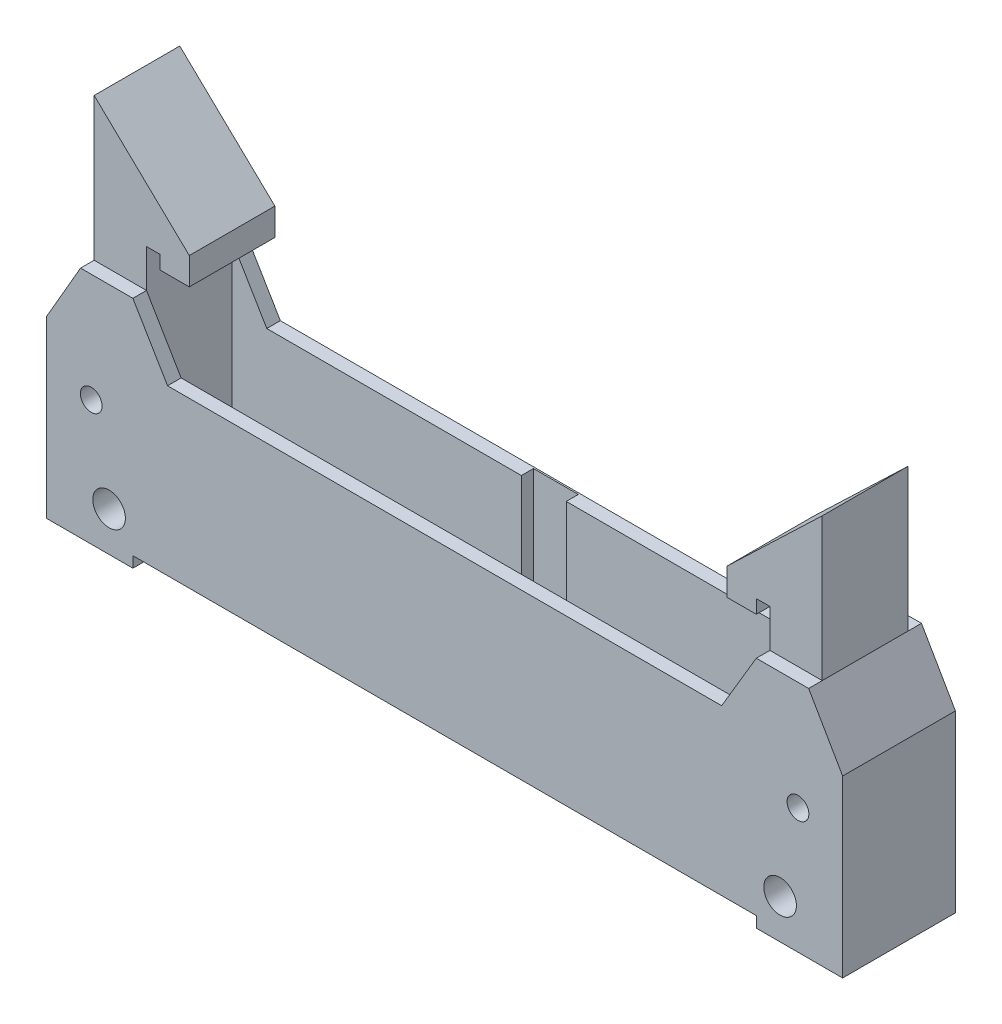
ISO-10303-21;
HEADER;
FILE_DESCRIPTION(('STEP AP214'),'2;1');
FILE_NAME('part.step','',(''),(''),'','','');
FILE_SCHEMA(('AUTOMOTIVE_DESIGN { 1 0 10303 214 1 1 1 1 }'));
ENDSEC;
DATA;
#1=APPLICATION_CONTEXT('core data for automotive mechanical design processes');
#2=APPLICATION_PROTOCOL_DEFINITION('international standard','automotive_design',2000,#1);
#3=PRODUCT_CONTEXT('',#1,'mechanical');
#4=PRODUCT('Part','Part','',(#3));
#5=PRODUCT_RELATED_PRODUCT_CATEGORY('part','',(#4));
#6=PRODUCT_DEFINITION_FORMATION('','',#4);
#7=PRODUCT_DEFINITION_CONTEXT('part definition',#1,'design');
#8=PRODUCT_DEFINITION('design','',#6,#7);
#9=PRODUCT_DEFINITION_SHAPE('','',#8);
#10=(LENGTH_UNIT() NAMED_UNIT(*) SI_UNIT(.MILLI.,.METRE.));
#11=(NAMED_UNIT(*) PLANE_ANGLE_UNIT() SI_UNIT($,.RADIAN.));
#12=(NAMED_UNIT(*) SI_UNIT($,.STERADIAN.) SOLID_ANGLE_UNIT());
#13=UNCERTAINTY_MEASURE_WITH_UNIT(LENGTH_MEASURE(1.E-05),#10,'distance_accuracy_value','');
#14=(GEOMETRIC_REPRESENTATION_CONTEXT(3) GLOBAL_UNCERTAINTY_ASSIGNED_CONTEXT((#13)) GLOBAL_UNIT_ASSIGNED_CONTEXT((#10,
#11,#12)) REPRESENTATION_CONTEXT('',''));
#15=CARTESIAN_POINT('',(0.,0.,0.));
#16=DIRECTION('',(0.,0.,1.));
#17=DIRECTION('',(1.,0.,0.));
#18=AXIS2_PLACEMENT_3D('',#15,#16,#17);
#19=CARTESIAN_POINT('',(-29.285,18.9999999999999,4.15000000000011));
#20=DIRECTION('',(0.,0.,1.));
#21=DIRECTION('',(1.,0.,0.));
#22=AXIS2_PLACEMENT_3D('',#19,#20,#21);
#23=PLANE('',#22);
#24=CARTESIAN_POINT('',(-26.,9.19999999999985,4.15));
#25=DIRECTION('',(0.,0.,1.));
#26=DIRECTION('',(1.,0.,0.));
#27=AXIS2_PLACEMENT_3D('',#24,#25,#26);
#28=CIRCLE('',#27,0.799999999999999);
#29=CARTESIAN_POINT('',(-25.2,9.19999999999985,4.15));
#30=VERTEX_POINT('',#29);
#31=EDGE_CURVE('E676',#30,#30,#28,.T.);
#32=ORIENTED_EDGE('',*,*,#31,.F.);
#33=EDGE_LOOP('',(#32));
#34=FACE_BOUND('',#33,.T.);
#35=CARTESIAN_POINT('',(26.,9.2,4.15));
#36=DIRECTION('',(0.,0.,1.));
#37=DIRECTION('',(1.,0.,0.));
#38=AXIS2_PLACEMENT_3D('',#35,#36,#37);
#39=CIRCLE('',#38,0.799999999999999);
#40=CARTESIAN_POINT('',(26.8,9.2,4.15));
#41=VERTEX_POINT('',#40);
#42=EDGE_CURVE('E670',#41,#41,#39,.T.);
#43=ORIENTED_EDGE('',*,*,#42,.F.);
#44=EDGE_LOOP('',(#43));
#45=FACE_BOUND('',#44,.T.);
#46=CARTESIAN_POINT('',(-24.685,2.905,4.15));
#47=DIRECTION('',(0.,0.,1.));
#48=DIRECTION('',(1.,0.,0.));
#49=AXIS2_PLACEMENT_3D('',#46,#47,#48);
#50=CIRCLE('',#49,1.2);
#51=CARTESIAN_POINT('',(-23.485,2.905,4.15));
#52=VERTEX_POINT('',#51);
#53=EDGE_CURVE('E439',#52,#52,#50,.T.);
#54=ORIENTED_EDGE('',*,*,#53,.F.);
#55=EDGE_LOOP('',(#54));
#56=FACE_BOUND('',#55,.T.);
#57=CARTESIAN_POINT('',(24.685,2.905,4.15));
#58=DIRECTION('',(0.,0.,1.));
#59=DIRECTION('',(1.,0.,0.));
#60=AXIS2_PLACEMENT_3D('',#57,#58,#59);
#61=CIRCLE('',#60,1.2);
#62=CARTESIAN_POINT('',(25.885,2.905,4.15));
#63=VERTEX_POINT('',#62);
#64=EDGE_CURVE('E445',#63,#63,#61,.T.);
#65=ORIENTED_EDGE('',*,*,#64,.F.);
#66=EDGE_LOOP('',(#65));
#67=FACE_BOUND('',#66,.T.);
#68=DIRECTION('',(-0.5,0.866025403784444,0.));
#69=VECTOR('',#68,1.);
#70=CARTESIAN_POINT('',(29.285,12.8698729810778,4.15));
#71=LINE('',#70,#69);
#72=CARTESIAN_POINT('',(29.285,12.8698729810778,4.15));
#73=VERTEX_POINT('',#72);
#74=CARTESIAN_POINT('',(26.785,17.2,4.15000000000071));
#75=VERTEX_POINT('',#74);
#76=EDGE_CURVE('E525',#73,#75,#71,.T.);
#77=ORIENTED_EDGE('',*,*,#76,.T.);
#78=DIRECTION('',(1.,0.,0.));
#79=VECTOR('',#78,1.);
#80=CARTESIAN_POINT('',(-31.3720501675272,17.2,4.15000000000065));
#81=LINE('',#80,#79);
#82=CARTESIAN_POINT('',(22.935,17.2,4.15000000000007));
#83=VERTEX_POINT('',#82);
#84=EDGE_CURVE('E290',#83,#75,#81,.T.);
#85=ORIENTED_EDGE('',*,*,#84,.F.);
#86=DIRECTION('',(-0.510294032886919,-0.860000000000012,0.));
#87=VECTOR('',#86,1.);
#88=CARTESIAN_POINT('',(22.935,17.2,4.15000000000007));
#89=LINE('',#88,#87);
#90=CARTESIAN_POINT('',(20.3835298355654,12.8999999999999,4.15));
#91=VERTEX_POINT('',#90);
#92=EDGE_CURVE('E527',#83,#91,#89,.T.);
#93=ORIENTED_EDGE('',*,*,#92,.T.);
#94=DIRECTION('',(-1.,0.,0.));
#95=VECTOR('',#94,1.);
#96=CARTESIAN_POINT('',(20.3835298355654,12.8999999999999,4.15));
#97=LINE('',#96,#95);
#98=CARTESIAN_POINT('',(-20.3835298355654,12.9,4.15));
#99=VERTEX_POINT('',#98);
#100=EDGE_CURVE('E529',#91,#99,#97,.T.);
#101=ORIENTED_EDGE('',*,*,#100,.T.);
#102=DIRECTION('',(-0.510294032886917,0.860000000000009,0.));
#103=VECTOR('',#102,1.);
#104=CARTESIAN_POINT('',(-22.935,17.1999999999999,4.15000000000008));
#105=LINE('',#104,#103);
#106=CARTESIAN_POINT('',(-22.935,17.1999999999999,4.15000000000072));
#107=VERTEX_POINT('',#106);
#108=EDGE_CURVE('E531',#99,#107,#105,.T.);
#109=ORIENTED_EDGE('',*,*,#108,.T.);
#110=CARTESIAN_POINT('',(-26.785,17.1999999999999,4.15000000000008));
#111=VERTEX_POINT('',#110);
#112=EDGE_CURVE('E665',#111,#107,#81,.T.);
#113=ORIENTED_EDGE('',*,*,#112,.F.);
#114=DIRECTION('',(-0.500000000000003,-0.866025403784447,0.));
#115=VECTOR('',#114,1.);
#116=CARTESIAN_POINT('',(-29.285,12.8698729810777,4.15000000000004));
#117=LINE('',#116,#115);
#118=CARTESIAN_POINT('',(-29.285,12.8698729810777,4.15000000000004));
#119=VERTEX_POINT('',#118);
#120=EDGE_CURVE('E58',#111,#119,#117,.T.);
#121=ORIENTED_EDGE('',*,*,#120,.T.);
#122=DIRECTION('',(0.,-1.00000000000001,0.));
#123=VECTOR('',#122,1.);
#124=CARTESIAN_POINT('',(-29.285,0.,4.15));
#125=LINE('',#124,#123);
#126=CARTESIAN_POINT('',(-29.285,0.,4.15));
#127=VERTEX_POINT('',#126);
#128=EDGE_CURVE('E511',#119,#127,#125,.T.);
#129=ORIENTED_EDGE('',*,*,#128,.T.);
#130=DIRECTION('',(1.,0.,0.));
#131=VECTOR('',#130,1.);
#132=CARTESIAN_POINT('',(-29.285,0.,4.15));
#133=LINE('',#132,#131);
#134=CARTESIAN_POINT('',(-22.935,0.,4.15));
#135=VERTEX_POINT('',#134);
#136=EDGE_CURVE('E513',#127,#135,#133,.T.);
#137=ORIENTED_EDGE('',*,*,#136,.T.);
#138=DIRECTION('',(0.,1.00000000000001,0.));
#139=VECTOR('',#138,1.);
#140=CARTESIAN_POINT('',(-22.935,0.799999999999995,4.15));
#141=LINE('',#140,#139);
#142=CARTESIAN_POINT('',(-22.935,0.799999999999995,4.15));
#143=VERTEX_POINT('',#142);
#144=EDGE_CURVE('E515',#135,#143,#141,.T.);
#145=ORIENTED_EDGE('',*,*,#144,.T.);
#146=DIRECTION('',(1.,0.,0.));
#147=VECTOR('',#146,1.);
#148=CARTESIAN_POINT('',(-22.935,0.799999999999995,4.15));
#149=LINE('',#148,#147);
#150=CARTESIAN_POINT('',(22.935,0.799999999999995,4.15));
#151=VERTEX_POINT('',#150);
#152=EDGE_CURVE('E517',#143,#151,#149,.T.);
#153=ORIENTED_EDGE('',*,*,#152,.T.);
#154=DIRECTION('',(0.,-1.00000000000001,0.));
#155=VECTOR('',#154,1.);
#156=CARTESIAN_POINT('',(22.935,0.799999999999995,4.15));
#157=LINE('',#156,#155);
#158=CARTESIAN_POINT('',(22.935,0.,4.15));
#159=VERTEX_POINT('',#158);
#160=EDGE_CURVE('E519',#151,#159,#157,.T.);
#161=ORIENTED_EDGE('',*,*,#160,.T.);
#162=DIRECTION('',(1.,0.,0.));
#163=VECTOR('',#162,1.);
#164=CARTESIAN_POINT('',(22.935,0.,4.15));
#165=LINE('',#164,#163);
#166=CARTESIAN_POINT('',(29.285,0.,4.15));
#167=VERTEX_POINT('',#166);
#168=EDGE_CURVE('E521',#159,#167,#165,.T.);
#169=ORIENTED_EDGE('',*,*,#168,.T.);
#170=DIRECTION('',(0.,1.00000000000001,0.));
#171=VECTOR('',#170,1.);
#172=CARTESIAN_POINT('',(29.285,0.,4.15));
#173=LINE('',#172,#171);
#174=EDGE_CURVE('E523',#167,#73,#173,.T.);
#175=ORIENTED_EDGE('',*,*,#174,.T.);
#176=EDGE_LOOP('',(#77,#85,#93,#101,#109,#113,#121,#129,#137,#145,#153,#161,#169,#175));
#177=FACE_BOUND('',#176,.T.);
#178=ADVANCED_FACE('F35',(#34,#45,#56,#67,#177),#23,.T.);
#179=CARTESIAN_POINT('',(-29.285,18.9999999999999,-4.14999999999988));
#180=DIRECTION('',(0.,0.,1.));
#181=DIRECTION('',(1.,0.,0.));
#182=AXIS2_PLACEMENT_3D('',#179,#180,#181);
#183=PLANE('',#182);
#184=CARTESIAN_POINT('',(-26.,9.19999999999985,-4.15));
#185=DIRECTION('',(0.,0.,1.));
#186=DIRECTION('',(1.,0.,0.));
#187=AXIS2_PLACEMENT_3D('',#184,#185,#186);
#188=CIRCLE('',#187,0.799999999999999);
#189=CARTESIAN_POINT('',(-25.2,9.19999999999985,-4.15));
#190=VERTEX_POINT('',#189);
#191=EDGE_CURVE('E673',#190,#190,#188,.T.);
#192=ORIENTED_EDGE('',*,*,#191,.T.);
#193=EDGE_LOOP('',(#192));
#194=FACE_BOUND('',#193,.T.);
#195=CARTESIAN_POINT('',(26.,9.2,-4.15));
#196=DIRECTION('',(0.,0.,1.));
#197=DIRECTION('',(1.,0.,0.));
#198=AXIS2_PLACEMENT_3D('',#195,#196,#197);
#199=CIRCLE('',#198,0.799999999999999);
#200=CARTESIAN_POINT('',(26.8,9.2,-4.15));
#201=VERTEX_POINT('',#200);
#202=EDGE_CURVE('E667',#201,#201,#199,.T.);
#203=ORIENTED_EDGE('',*,*,#202,.T.);
#204=EDGE_LOOP('',(#203));
#205=FACE_BOUND('',#204,.T.);
#206=CARTESIAN_POINT('',(-24.685,2.905,-4.15));
#207=DIRECTION('',(0.,0.,1.));
#208=DIRECTION('',(1.,0.,0.));
#209=AXIS2_PLACEMENT_3D('',#206,#207,#208);
#210=CIRCLE('',#209,1.2);
#211=CARTESIAN_POINT('',(-23.485,2.90500000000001,-4.15));
#212=VERTEX_POINT('',#211);
#213=EDGE_CURVE('E436',#212,#212,#210,.T.);
#214=ORIENTED_EDGE('',*,*,#213,.T.);
#215=EDGE_LOOP('',(#214));
#216=FACE_BOUND('',#215,.T.);
#217=CARTESIAN_POINT('',(24.685,2.905,-4.15));
#218=DIRECTION('',(0.,0.,1.));
#219=DIRECTION('',(1.,0.,0.));
#220=AXIS2_PLACEMENT_3D('',#217,#218,#219);
#221=CIRCLE('',#220,1.2);
#222=CARTESIAN_POINT('',(25.885,2.905,-4.15));
#223=VERTEX_POINT('',#222);
#224=EDGE_CURVE('E442',#223,#223,#221,.T.);
#225=ORIENTED_EDGE('',*,*,#224,.T.);
#226=EDGE_LOOP('',(#225));
#227=FACE_BOUND('',#226,.T.);
#228=DIRECTION('',(-1.,0.,0.));
#229=VECTOR('',#228,1.);
#230=CARTESIAN_POINT('',(-30.3112876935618,17.2,-4.14999999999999));
#231=LINE('',#230,#229);
#232=CARTESIAN_POINT('',(26.785,17.2,-4.14999999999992));
#233=VERTEX_POINT('',#232);
#234=CARTESIAN_POINT('',(22.935,17.2,-4.14999999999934));
#235=VERTEX_POINT('',#234);
#236=EDGE_CURVE('E595',#233,#235,#231,.T.);
#237=ORIENTED_EDGE('',*,*,#236,.F.);
#238=DIRECTION('',(-0.5,0.866025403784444,0.));
#239=VECTOR('',#238,1.);
#240=CARTESIAN_POINT('',(29.285,12.8698729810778,-4.14999999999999));
#241=LINE('',#240,#239);
#242=CARTESIAN_POINT('',(29.285,12.8698729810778,-4.14999999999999));
#243=VERTEX_POINT('',#242);
#244=EDGE_CURVE('E498',#243,#233,#241,.T.);
#245=ORIENTED_EDGE('',*,*,#244,.F.);
#246=DIRECTION('',(0.,1.00000000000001,0.));
#247=VECTOR('',#246,1.);
#248=CARTESIAN_POINT('',(29.285,0.,-4.15));
#249=LINE('',#248,#247);
#250=CARTESIAN_POINT('',(29.285,0.,-4.15));
#251=VERTEX_POINT('',#250);
#252=EDGE_CURVE('E496',#251,#243,#249,.T.);
#253=ORIENTED_EDGE('',*,*,#252,.F.);
#254=DIRECTION('',(1.,0.,0.));
#255=VECTOR('',#254,1.);
#256=CARTESIAN_POINT('',(22.935,0.,-4.15));
#257=LINE('',#256,#255);
#258=CARTESIAN_POINT('',(22.935,0.,-4.15));
#259=VERTEX_POINT('',#258);
#260=EDGE_CURVE('E494',#259,#251,#257,.T.);
#261=ORIENTED_EDGE('',*,*,#260,.F.);
#262=DIRECTION('',(0.,-1.00000000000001,0.));
#263=VECTOR('',#262,1.);
#264=CARTESIAN_POINT('',(22.935,0.800000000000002,-4.15));
#265=LINE('',#264,#263);
#266=CARTESIAN_POINT('',(22.935,0.800000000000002,-4.15));
#267=VERTEX_POINT('',#266);
#268=EDGE_CURVE('E492',#267,#259,#265,.T.);
#269=ORIENTED_EDGE('',*,*,#268,.F.);
#270=DIRECTION('',(1.,0.,0.));
#271=VECTOR('',#270,1.);
#272=CARTESIAN_POINT('',(-22.935,0.800000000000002,-4.15));
#273=LINE('',#272,#271);
#274=CARTESIAN_POINT('',(-22.935,0.800000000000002,-4.15));
#275=VERTEX_POINT('',#274);
#276=EDGE_CURVE('E490',#275,#267,#273,.T.);
#277=ORIENTED_EDGE('',*,*,#276,.F.);
#278=DIRECTION('',(0.,1.00000000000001,0.));
#279=VECTOR('',#278,1.);
#280=CARTESIAN_POINT('',(-22.935,0.800000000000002,-4.15));
#281=LINE('',#280,#279);
#282=CARTESIAN_POINT('',(-22.935,0.,-4.15));
#283=VERTEX_POINT('',#282);
#284=EDGE_CURVE('E488',#283,#275,#281,.T.);
#285=ORIENTED_EDGE('',*,*,#284,.F.);
#286=DIRECTION('',(1.,0.,0.));
#287=VECTOR('',#286,1.);
#288=CARTESIAN_POINT('',(-29.285,0.,-4.15));
#289=LINE('',#288,#287);
#290=CARTESIAN_POINT('',(-29.285,0.,-4.15));
#291=VERTEX_POINT('',#290);
#292=EDGE_CURVE('E486',#291,#283,#289,.T.);
#293=ORIENTED_EDGE('',*,*,#292,.F.);
#294=DIRECTION('',(0.,-1.00000000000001,0.));
#295=VECTOR('',#294,1.);
#296=CARTESIAN_POINT('',(-29.285,0.,-4.15));
#297=LINE('',#296,#295);
#298=CARTESIAN_POINT('',(-29.285,12.8698729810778,-4.14999999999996));
#299=VERTEX_POINT('',#298);
#300=EDGE_CURVE('E483',#299,#291,#297,.T.);
#301=ORIENTED_EDGE('',*,*,#300,.F.);
#302=DIRECTION('',(-0.500000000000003,-0.866025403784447,0.));
#303=VECTOR('',#302,1.);
#304=CARTESIAN_POINT('',(-29.285,12.8698729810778,-4.14999999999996));
#305=LINE('',#304,#303);
#306=CARTESIAN_POINT('',(-26.785,17.1999999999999,-4.14999999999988));
#307=VERTEX_POINT('',#306);
#308=EDGE_CURVE('E509',#307,#299,#305,.T.);
#309=ORIENTED_EDGE('',*,*,#308,.F.);
#310=CARTESIAN_POINT('',(-22.935,17.1999999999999,-4.14999999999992));
#311=VERTEX_POINT('',#310);
#312=EDGE_CURVE('E594',#311,#307,#231,.T.);
#313=ORIENTED_EDGE('',*,*,#312,.F.);
#314=DIRECTION('',(-0.510294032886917,0.860000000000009,0.));
#315=VECTOR('',#314,1.);
#316=CARTESIAN_POINT('',(-22.935,17.1999999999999,-4.14999999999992));
#317=LINE('',#316,#315);
#318=CARTESIAN_POINT('',(-20.3835298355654,12.9,-4.15));
#319=VERTEX_POINT('',#318);
#320=EDGE_CURVE('E506',#319,#311,#317,.T.);
#321=ORIENTED_EDGE('',*,*,#320,.F.);
#322=DIRECTION('',(-1.,0.,0.));
#323=VECTOR('',#322,1.);
#324=CARTESIAN_POINT('',(-20.3835298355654,12.9,-4.15));
#325=LINE('',#324,#323);
#326=CARTESIAN_POINT('',(20.3835298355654,12.9,-4.14999999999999));
#327=VERTEX_POINT('',#326);
#328=EDGE_CURVE('E503',#327,#319,#325,.T.);
#329=ORIENTED_EDGE('',*,*,#328,.F.);
#330=DIRECTION('',(-0.510294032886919,-0.860000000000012,0.));
#331=VECTOR('',#330,1.);
#332=CARTESIAN_POINT('',(22.935,17.2,-4.14999999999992));
#333=LINE('',#332,#331);
#334=EDGE_CURVE('E500',#235,#327,#333,.T.);
#335=ORIENTED_EDGE('',*,*,#334,.F.);
#336=EDGE_LOOP('',(#237,#245,#253,#261,#269,#277,#285,#293,#301,#309,#313,#321,#329,#335));
#337=FACE_BOUND('',#336,.T.);
#338=ADVANCED_FACE('F611',(#194,#205,#216,#227,#337),#183,.F.);
#339=CARTESIAN_POINT('',(-22.935,-45.5006144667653,-3.14999999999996));
#340=DIRECTION('',(0.,0.,-1.));
#341=DIRECTION('',(-1.,0.,0.));
#342=AXIS2_PLACEMENT_3D('',#339,#340,#341);
#343=PLANE('',#342);
#344=DIRECTION('',(1.,0.,0.));
#345=VECTOR('',#344,1.);
#346=CARTESIAN_POINT('',(-20.3835298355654,12.9,-3.15));
#347=LINE('',#346,#345);
#348=CARTESIAN_POINT('',(1.651,12.9,-3.15));
#349=VERTEX_POINT('',#348);
#350=CARTESIAN_POINT('',(20.3835298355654,12.8999999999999,-3.15));
#351=VERTEX_POINT('',#350);
#352=EDGE_CURVE('E476',#349,#351,#347,.T.);
#353=ORIENTED_EDGE('',*,*,#352,.F.);
#354=DIRECTION('',(0.,-1.00000000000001,0.));
#355=VECTOR('',#354,1.);
#356=CARTESIAN_POINT('',(1.65099999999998,-45.5006144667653,-3.14999999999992));
#357=LINE('',#356,#355);
#358=CARTESIAN_POINT('',(1.651,1.8,-3.15000000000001));
#359=VERTEX_POINT('',#358);
#360=EDGE_CURVE('E433',#349,#359,#357,.T.);
#361=ORIENTED_EDGE('',*,*,#360,.T.);
#362=DIRECTION('',(1.,0.,0.));
#363=VECTOR('',#362,1.);
#364=CARTESIAN_POINT('',(-22.935,1.8,-3.15));
#365=LINE('',#364,#363);
#366=CARTESIAN_POINT('',(22.935,1.8,-3.15000000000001));
#367=VERTEX_POINT('',#366);
#368=EDGE_CURVE('E451',#359,#367,#365,.T.);
#369=ORIENTED_EDGE('',*,*,#368,.T.);
#370=DIRECTION('',(0.,1.00000000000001,0.));
#371=VECTOR('',#370,1.);
#372=CARTESIAN_POINT('',(22.935,-45.5006144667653,-3.15));
#373=LINE('',#372,#371);
#374=CARTESIAN_POINT('',(22.935,17.2,-3.14999999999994));
#375=VERTEX_POINT('',#374);
#376=EDGE_CURVE('E461',#367,#375,#373,.T.);
#377=ORIENTED_EDGE('',*,*,#376,.T.);
#378=DIRECTION('',(0.510294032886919,0.860000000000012,0.));
#379=VECTOR('',#378,1.);
#380=CARTESIAN_POINT('',(22.935,17.2,-3.14999999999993));
#381=LINE('',#380,#379);
#382=EDGE_CURVE('E480',#351,#375,#381,.T.);
#383=ORIENTED_EDGE('',*,*,#382,.F.);
#384=EDGE_LOOP('',(#353,#361,#369,#377,#383));
#385=FACE_BOUND('',#384,.T.);
#386=ADVANCED_FACE('F621',(#385),#343,.F.);
#387=CARTESIAN_POINT('',(22.935,17.2,4.15000000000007));
#388=DIRECTION('',(0.860000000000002,-0.51029403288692,0.));
#389=DIRECTION('',(0.510294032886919,0.860000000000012,0.));
#390=AXIS2_PLACEMENT_3D('',#387,#388,#389);
#391=PLANE('',#390);
#392=DIRECTION('',(0.,0.,-1.));
#393=VECTOR('',#392,1.);
#394=CARTESIAN_POINT('',(20.3835298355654,12.8999999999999,4.15));
#395=LINE('',#394,#393);
#396=EDGE_CURVE('E557',#351,#327,#395,.T.);
#397=ORIENTED_EDGE('',*,*,#396,.F.);
#398=ORIENTED_EDGE('',*,*,#382,.T.);
#399=DIRECTION('',(0.,0.,-1.));
#400=VECTOR('',#399,1.);
#401=CARTESIAN_POINT('',(22.935,17.2,4.15000000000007));
#402=LINE('',#401,#400);
#403=EDGE_CURVE('E561',#375,#235,#402,.T.);
#404=ORIENTED_EDGE('',*,*,#403,.T.);
#405=ORIENTED_EDGE('',*,*,#334,.T.);
#406=EDGE_LOOP('',(#397,#398,#404,#405));
#407=FACE_BOUND('',#406,.T.);
#408=ADVANCED_FACE('F608',(#407),#391,.F.);
#409=CARTESIAN_POINT('',(-20.3835298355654,12.9,4.15));
#410=DIRECTION('',(0.,-1.00000000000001,0.));
#411=DIRECTION('',(0.,0.,-1.));
#412=AXIS2_PLACEMENT_3D('',#409,#410,#411);
#413=PLANE('',#412);
#414=DIRECTION('',(-1.,0.,0.));
#415=VECTOR('',#414,1.);
#416=CARTESIAN_POINT('',(1.65100000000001,12.9,-4.039));
#417=LINE('',#416,#415);
#418=CARTESIAN_POINT('',(1.65100000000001,12.9,-4.039));
#419=VERTEX_POINT('',#418);
#420=CARTESIAN_POINT('',(-1.651,12.9,-4.039));
#421=VERTEX_POINT('',#420);
#422=EDGE_CURVE('E415',#419,#421,#417,.T.);
#423=ORIENTED_EDGE('',*,*,#422,.F.);
#424=DIRECTION('',(0.,0.,-1.));
#425=VECTOR('',#424,1.);
#426=CARTESIAN_POINT('',(1.651,12.9,-2.896));
#427=LINE('',#426,#425);
#428=EDGE_CURVE('E413',#349,#419,#427,.T.);
#429=ORIENTED_EDGE('',*,*,#428,.F.);
#430=ORIENTED_EDGE('',*,*,#352,.T.);
#431=ORIENTED_EDGE('',*,*,#396,.T.);
#432=ORIENTED_EDGE('',*,*,#328,.T.);
#433=DIRECTION('',(0.,0.,-1.));
#434=VECTOR('',#433,1.);
#435=CARTESIAN_POINT('',(-20.3835298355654,12.9,4.15));
#436=LINE('',#435,#434);
#437=CARTESIAN_POINT('',(-20.3835298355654,12.9,-3.15));
#438=VERTEX_POINT('',#437);
#439=EDGE_CURVE('E553',#438,#319,#436,.T.);
#440=ORIENTED_EDGE('',*,*,#439,.F.);
#441=CARTESIAN_POINT('',(-1.651,12.9,-3.15));
#442=VERTEX_POINT('',#441);
#443=EDGE_CURVE('E477',#438,#442,#347,.T.);
#444=ORIENTED_EDGE('',*,*,#443,.T.);
#445=DIRECTION('',(0.,0.,1.));
#446=VECTOR('',#445,1.);
#447=CARTESIAN_POINT('',(-1.651,12.9,-2.896));
#448=LINE('',#447,#446);
#449=EDGE_CURVE('E418',#421,#442,#448,.T.);
#450=ORIENTED_EDGE('',*,*,#449,.F.);
#451=EDGE_LOOP('',(#423,#429,#430,#431,#432,#440,#444,#450));
#452=FACE_BOUND('',#451,.T.);
#453=ADVANCED_FACE('F617',(#452),#413,.F.);
#454=CARTESIAN_POINT('',(-22.935,17.1999999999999,4.15000000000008));
#455=DIRECTION('',(-0.860000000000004,-0.510294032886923,0.));
#456=DIRECTION('',(0.510294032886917,-0.860000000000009,0.));
#457=AXIS2_PLACEMENT_3D('',#454,#455,#456);
#458=PLANE('',#457);
#459=DIRECTION('',(0.,0.,-1.));
#460=VECTOR('',#459,1.);
#461=CARTESIAN_POINT('',(-22.935,17.1999999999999,4.15000000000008));
#462=LINE('',#461,#460);
#463=CARTESIAN_POINT('',(-22.935,17.1999999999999,-3.14999999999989));
#464=VERTEX_POINT('',#463);
#465=EDGE_CURVE('E550',#464,#311,#462,.T.);
#466=ORIENTED_EDGE('',*,*,#465,.F.);
#467=DIRECTION('',(0.510294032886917,-0.860000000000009,0.));
#468=VECTOR('',#467,1.);
#469=CARTESIAN_POINT('',(-22.935,17.1999999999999,-3.14999999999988));
#470=LINE('',#469,#468);
#471=EDGE_CURVE('E348',#464,#438,#470,.T.);
#472=ORIENTED_EDGE('',*,*,#471,.T.);
#473=ORIENTED_EDGE('',*,*,#439,.T.);
#474=ORIENTED_EDGE('',*,*,#320,.T.);
#475=EDGE_LOOP('',(#466,#472,#473,#474));
#476=FACE_BOUND('',#475,.T.);
#477=ADVANCED_FACE('F752',(#476),#458,.F.);
#478=CARTESIAN_POINT('',(-29.285,0.,4.15));
#479=DIRECTION('',(1.,0.,0.));
#480=DIRECTION('',(0.,0.,-1.));
#481=AXIS2_PLACEMENT_3D('',#478,#479,#480);
#482=PLANE('',#481);
#483=ORIENTED_EDGE('',*,*,#300,.T.);
#484=DIRECTION('',(0.,0.,-1.));
#485=VECTOR('',#484,1.);
#486=CARTESIAN_POINT('',(-29.285,0.,4.15));
#487=LINE('',#486,#485);
#488=EDGE_CURVE('E342',#127,#291,#487,.T.);
#489=ORIENTED_EDGE('',*,*,#488,.F.);
#490=ORIENTED_EDGE('',*,*,#128,.F.);
#491=DIRECTION('',(0.,0.,-1.));
#492=VECTOR('',#491,1.);
#493=CARTESIAN_POINT('',(-29.285,12.8698729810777,4.15000000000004));
#494=LINE('',#493,#492);
#495=EDGE_CURVE('E535',#119,#299,#494,.T.);
#496=ORIENTED_EDGE('',*,*,#495,.T.);
#497=EDGE_LOOP('',(#483,#489,#490,#496));
#498=FACE_BOUND('',#497,.T.);
#499=ADVANCED_FACE('F37',(#498),#482,.F.);
#500=CARTESIAN_POINT('',(-29.285,0.,4.15));
#501=DIRECTION('',(0.,1.00000000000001,0.));
#502=DIRECTION('',(0.,0.,1.));
#503=AXIS2_PLACEMENT_3D('',#500,#501,#502);
#504=PLANE('',#503);
#505=ORIENTED_EDGE('',*,*,#292,.T.);
#506=DIRECTION('',(0.,0.,-1.));
#507=VECTOR('',#506,1.);
#508=CARTESIAN_POINT('',(-22.935,0.,4.15));
#509=LINE('',#508,#507);
#510=EDGE_CURVE('E339',#135,#283,#509,.T.);
#511=ORIENTED_EDGE('',*,*,#510,.F.);
#512=ORIENTED_EDGE('',*,*,#136,.F.);
#513=ORIENTED_EDGE('',*,*,#488,.T.);
#514=EDGE_LOOP('',(#505,#511,#512,#513));
#515=FACE_BOUND('',#514,.T.);
#516=ADVANCED_FACE('F718',(#515),#504,.F.);
#517=CARTESIAN_POINT('',(-22.935,0.799999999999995,4.15));
#518=DIRECTION('',(-1.,0.,0.));
#519=DIRECTION('',(0.,0.,1.));
#520=AXIS2_PLACEMENT_3D('',#517,#518,#519);
#521=PLANE('',#520);
#522=ORIENTED_EDGE('',*,*,#284,.T.);
#523=DIRECTION('',(0.,0.,-1.));
#524=VECTOR('',#523,1.);
#525=CARTESIAN_POINT('',(-22.935,0.799999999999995,4.15));
#526=LINE('',#525,#524);
#527=EDGE_CURVE('E336',#143,#275,#526,.T.);
#528=ORIENTED_EDGE('',*,*,#527,.F.);
#529=ORIENTED_EDGE('',*,*,#144,.F.);
#530=ORIENTED_EDGE('',*,*,#510,.T.);
#531=EDGE_LOOP('',(#522,#528,#529,#530));
#532=FACE_BOUND('',#531,.T.);
#533=ADVANCED_FACE('F715',(#532),#521,.F.);
#534=CARTESIAN_POINT('',(-22.935,0.799999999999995,4.15));
#535=DIRECTION('',(0.,1.00000000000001,0.));
#536=DIRECTION('',(0.,0.,1.));
#537=AXIS2_PLACEMENT_3D('',#534,#535,#536);
#538=PLANE('',#537);
#539=ORIENTED_EDGE('',*,*,#276,.T.);
#540=DIRECTION('',(0.,0.,-1.));
#541=VECTOR('',#540,1.);
#542=CARTESIAN_POINT('',(22.935,0.799999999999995,4.15));
#543=LINE('',#542,#541);
#544=EDGE_CURVE('E333',#151,#267,#543,.T.);
#545=ORIENTED_EDGE('',*,*,#544,.F.);
#546=ORIENTED_EDGE('',*,*,#152,.F.);
#547=ORIENTED_EDGE('',*,*,#527,.T.);
#548=EDGE_LOOP('',(#539,#545,#546,#547));
#549=FACE_BOUND('',#548,.T.);
#550=ADVANCED_FACE('F710',(#549),#538,.F.);
#551=CARTESIAN_POINT('',(22.935,0.799999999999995,4.15));
#552=DIRECTION('',(1.,0.,0.));
#553=DIRECTION('',(0.,0.,-1.));
#554=AXIS2_PLACEMENT_3D('',#551,#552,#553);
#555=PLANE('',#554);
#556=ORIENTED_EDGE('',*,*,#268,.T.);
#557=DIRECTION('',(0.,0.,-1.));
#558=VECTOR('',#557,1.);
#559=CARTESIAN_POINT('',(22.935,0.,4.15));
#560=LINE('',#559,#558);
#561=EDGE_CURVE('E330',#159,#259,#560,.T.);
#562=ORIENTED_EDGE('',*,*,#561,.F.);
#563=ORIENTED_EDGE('',*,*,#160,.F.);
#564=ORIENTED_EDGE('',*,*,#544,.T.);
#565=EDGE_LOOP('',(#556,#562,#563,#564));
#566=FACE_BOUND('',#565,.T.);
#567=ADVANCED_FACE('F705',(#566),#555,.F.);
#568=CARTESIAN_POINT('',(22.935,0.,4.15));
#569=DIRECTION('',(0.,1.00000000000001,0.));
#570=DIRECTION('',(0.,0.,1.));
#571=AXIS2_PLACEMENT_3D('',#568,#569,#570);
#572=PLANE('',#571);
#573=ORIENTED_EDGE('',*,*,#260,.T.);
#574=DIRECTION('',(0.,0.,-1.));
#575=VECTOR('',#574,1.);
#576=CARTESIAN_POINT('',(29.285,0.,4.15));
#577=LINE('',#576,#575);
#578=EDGE_CURVE('E327',#167,#251,#577,.T.);
#579=ORIENTED_EDGE('',*,*,#578,.F.);
#580=ORIENTED_EDGE('',*,*,#168,.F.);
#581=ORIENTED_EDGE('',*,*,#561,.T.);
#582=EDGE_LOOP('',(#573,#579,#580,#581));
#583=FACE_BOUND('',#582,.T.);
#584=ADVANCED_FACE('F701',(#583),#572,.F.);
#585=CARTESIAN_POINT('',(29.285,0.,4.15));
#586=DIRECTION('',(-1.,0.,0.));
#587=DIRECTION('',(0.,0.,1.));
#588=AXIS2_PLACEMENT_3D('',#585,#586,#587);
#589=PLANE('',#588);
#590=ORIENTED_EDGE('',*,*,#252,.T.);
#591=DIRECTION('',(0.,0.,-1.));
#592=VECTOR('',#591,1.);
#593=CARTESIAN_POINT('',(29.285,12.8698729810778,4.15));
#594=LINE('',#593,#592);
#595=EDGE_CURVE('E295',#73,#243,#594,.T.);
#596=ORIENTED_EDGE('',*,*,#595,.F.);
#597=ORIENTED_EDGE('',*,*,#174,.F.);
#598=ORIENTED_EDGE('',*,*,#578,.T.);
#599=EDGE_LOOP('',(#590,#596,#597,#598));
#600=FACE_BOUND('',#599,.T.);
#601=ADVANCED_FACE('F697',(#600),#589,.F.);
#602=CARTESIAN_POINT('',(29.285,12.8698729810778,4.15));
#603=DIRECTION('',(-0.866025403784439,-0.500000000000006,0.));
#604=DIRECTION('',(0.5,-0.866025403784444,0.));
#605=AXIS2_PLACEMENT_3D('',#602,#603,#604);
#606=PLANE('',#605);
#607=ORIENTED_EDGE('',*,*,#244,.T.);
#608=DIRECTION('',(0.,0.,-1.));
#609=VECTOR('',#608,1.);
#610=CARTESIAN_POINT('',(26.785,17.2,4.15000000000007));
#611=LINE('',#610,#609);
#612=CARTESIAN_POINT('',(26.785,17.2,-3.14999999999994));
#613=VERTEX_POINT('',#612);
#614=EDGE_CURVE('E320',#613,#233,#611,.T.);
#615=ORIENTED_EDGE('',*,*,#614,.F.);
#616=DIRECTION('',(0.,0.,-1.));
#617=VECTOR('',#616,1.);
#618=CARTESIAN_POINT('',(26.785,17.2,4.15000000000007));
#619=LINE('',#618,#617);
#620=CARTESIAN_POINT('',(26.785,17.2,3.15000000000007));
#621=VERTEX_POINT('',#620);
#622=EDGE_CURVE('E296',#621,#613,#619,.T.);
#623=ORIENTED_EDGE('',*,*,#622,.F.);
#624=EDGE_CURVE('E284',#75,#621,#619,.T.);
#625=ORIENTED_EDGE('',*,*,#624,.F.);
#626=ORIENTED_EDGE('',*,*,#76,.F.);
#627=ORIENTED_EDGE('',*,*,#595,.T.);
#628=EDGE_LOOP('',(#607,#615,#623,#625,#626,#627));
#629=FACE_BOUND('',#628,.T.);
#630=ADVANCED_FACE('F319',(#629),#606,.F.);
#631=CARTESIAN_POINT('',(26.785,17.2,4.15000000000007));
#632=DIRECTION('',(-1.,0.,0.));
#633=DIRECTION('',(0.,0.,1.));
#634=AXIS2_PLACEMENT_3D('',#631,#632,#633);
#635=PLANE('',#634);
#636=DIRECTION('',(0.,0.,-1.));
#637=VECTOR('',#636,1.);
#638=CARTESIAN_POINT('',(26.785,27.7,4.15));
#639=LINE('',#638,#637);
#640=CARTESIAN_POINT('',(26.785,27.7,3.14999999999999));
#641=VERTEX_POINT('',#640);
#642=CARTESIAN_POINT('',(26.785,27.7,-3.15000000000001));
#643=VERTEX_POINT('',#642);
#644=EDGE_CURVE('E313',#641,#643,#639,.T.);
#645=ORIENTED_EDGE('',*,*,#644,.F.);
#646=DIRECTION('',(0.,-1.00000000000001,0.));
#647=VECTOR('',#646,1.);
#648=CARTESIAN_POINT('',(26.785,17.2,3.15000000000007));
#649=LINE('',#648,#647);
#650=EDGE_CURVE('E301',#641,#621,#649,.T.);
#651=ORIENTED_EDGE('',*,*,#650,.T.);
#652=ORIENTED_EDGE('',*,*,#622,.T.);
#653=DIRECTION('',(0.,1.00000000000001,0.));
#654=VECTOR('',#653,1.);
#655=CARTESIAN_POINT('',(26.785,17.2,-3.14999999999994));
#656=LINE('',#655,#654);
#657=EDGE_CURVE('E411',#613,#643,#656,.T.);
#658=ORIENTED_EDGE('',*,*,#657,.T.);
#659=EDGE_LOOP('',(#645,#651,#652,#658));
#660=FACE_BOUND('',#659,.T.);
#661=ADVANCED_FACE('F310',(#660),#635,.F.);
#662=CARTESIAN_POINT('',(19.785,20.9999999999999,4.15000000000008));
#663=DIRECTION('',(0.691456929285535,-0.72241768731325,0.));
#664=DIRECTION('',(0.722417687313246,0.691456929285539,0.));
#665=AXIS2_PLACEMENT_3D('',#662,#663,#664);
#666=PLANE('',#665);
#667=DIRECTION('',(0.,0.,-1.));
#668=VECTOR('',#667,1.);
#669=CARTESIAN_POINT('',(19.785,20.9999999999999,4.15000000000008));
#670=LINE('',#669,#668);
#671=CARTESIAN_POINT('',(19.785,20.9999999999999,3.15000000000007));
#672=VERTEX_POINT('',#671);
#673=CARTESIAN_POINT('',(19.785,20.9999999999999,-3.14999999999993));
#674=VERTEX_POINT('',#673);
#675=EDGE_CURVE('E321',#672,#674,#670,.T.);
#676=ORIENTED_EDGE('',*,*,#675,.F.);
#677=DIRECTION('',(0.722417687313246,0.691456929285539,0.));
#678=VECTOR('',#677,1.);
#679=CARTESIAN_POINT('',(19.785,20.9999999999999,3.15000000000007));
#680=LINE('',#679,#678);
#681=EDGE_CURVE('E315',#672,#641,#680,.T.);
#682=ORIENTED_EDGE('',*,*,#681,.T.);
#683=ORIENTED_EDGE('',*,*,#644,.T.);
#684=DIRECTION('',(-0.722417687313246,-0.691456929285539,0.));
#685=VECTOR('',#684,1.);
#686=CARTESIAN_POINT('',(19.785,20.9999999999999,-3.14999999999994));
#687=LINE('',#686,#685);
#688=EDGE_CURVE('E408',#643,#674,#687,.T.);
#689=ORIENTED_EDGE('',*,*,#688,.T.);
#690=EDGE_LOOP('',(#676,#682,#683,#689));
#691=FACE_BOUND('',#690,.T.);
#692=ADVANCED_FACE('F586',(#691),#666,.F.);
#693=CARTESIAN_POINT('',(19.785,18.9999999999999,4.15000000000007));
#694=DIRECTION('',(1.,0.,0.));
#695=DIRECTION('',(0.,0.,-1.));
#696=AXIS2_PLACEMENT_3D('',#693,#694,#695);
#697=PLANE('',#696);
#698=DIRECTION('',(0.,0.,-1.));
#699=VECTOR('',#698,1.);
#700=CARTESIAN_POINT('',(19.785,18.9999999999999,4.15000000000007));
#701=LINE('',#700,#699);
#702=CARTESIAN_POINT('',(19.785,18.9999999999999,3.15000000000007));
#703=VERTEX_POINT('',#702);
#704=CARTESIAN_POINT('',(19.785,18.9999999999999,-3.14999999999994));
#705=VERTEX_POINT('',#704);
#706=EDGE_CURVE('E571',#703,#705,#701,.T.);
#707=ORIENTED_EDGE('',*,*,#706,.F.);
#708=DIRECTION('',(0.,1.00000000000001,0.));
#709=VECTOR('',#708,1.);
#710=CARTESIAN_POINT('',(19.785,18.9999999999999,3.15000000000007));
#711=LINE('',#710,#709);
#712=EDGE_CURVE('E578',#703,#672,#711,.T.);
#713=ORIENTED_EDGE('',*,*,#712,.T.);
#714=ORIENTED_EDGE('',*,*,#675,.T.);
#715=DIRECTION('',(0.,-1.00000000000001,0.));
#716=VECTOR('',#715,1.);
#717=CARTESIAN_POINT('',(19.785,18.9999999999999,-3.14999999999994));
#718=LINE('',#717,#716);
#719=EDGE_CURVE('E405',#674,#705,#718,.T.);
#720=ORIENTED_EDGE('',*,*,#719,.T.);
#721=EDGE_LOOP('',(#707,#713,#714,#720));
#722=FACE_BOUND('',#721,.T.);
#723=ADVANCED_FACE('F577',(#722),#697,.F.);
#724=CARTESIAN_POINT('',(19.785,18.9999999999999,4.15000000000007));
#725=DIRECTION('',(0.,1.00000000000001,0.));
#726=DIRECTION('',(0.,0.,1.));
#727=AXIS2_PLACEMENT_3D('',#724,#725,#726);
#728=PLANE('',#727);
#729=DIRECTION('',(0.,0.,-1.));
#730=VECTOR('',#729,1.);
#731=CARTESIAN_POINT('',(21.935,19.,4.15000000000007));
#732=LINE('',#731,#730);
#733=CARTESIAN_POINT('',(21.935,19.,3.15000000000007));
#734=VERTEX_POINT('',#733);
#735=CARTESIAN_POINT('',(21.935,19.,-3.14999999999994));
#736=VERTEX_POINT('',#735);
#737=EDGE_CURVE('E569',#734,#736,#732,.T.);
#738=ORIENTED_EDGE('',*,*,#737,.F.);
#739=DIRECTION('',(-1.,0.,0.));
#740=VECTOR('',#739,1.);
#741=CARTESIAN_POINT('',(19.785,18.9999999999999,3.15000000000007));
#742=LINE('',#741,#740);
#743=EDGE_CURVE('E588',#734,#703,#742,.T.);
#744=ORIENTED_EDGE('',*,*,#743,.T.);
#745=ORIENTED_EDGE('',*,*,#706,.T.);
#746=DIRECTION('',(1.,0.,0.));
#747=VECTOR('',#746,1.);
#748=CARTESIAN_POINT('',(19.785,18.9999999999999,-3.14999999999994));
#749=LINE('',#748,#747);
#750=EDGE_CURVE('E402',#705,#736,#749,.T.);
#751=ORIENTED_EDGE('',*,*,#750,.T.);
#752=EDGE_LOOP('',(#738,#744,#745,#751));
#753=FACE_BOUND('',#752,.T.);
#754=ADVANCED_FACE('F642',(#753),#728,.F.);
#755=CARTESIAN_POINT('',(21.935,19.,4.15000000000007));
#756=DIRECTION('',(-1.,0.,0.));
#757=DIRECTION('',(0.,0.,1.));
#758=AXIS2_PLACEMENT_3D('',#755,#756,#757);
#759=PLANE('',#758);
#760=DIRECTION('',(0.,0.,-1.));
#761=VECTOR('',#760,1.);
#762=CARTESIAN_POINT('',(21.935,20.,4.15000000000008));
#763=LINE('',#762,#761);
#764=CARTESIAN_POINT('',(21.935,20.,3.15000000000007));
#765=VERTEX_POINT('',#764);
#766=CARTESIAN_POINT('',(21.935,20.,-3.14999999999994));
#767=VERTEX_POINT('',#766);
#768=EDGE_CURVE('E567',#765,#767,#763,.T.);
#769=ORIENTED_EDGE('',*,*,#768,.F.);
#770=DIRECTION('',(0.,-1.00000000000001,0.));
#771=VECTOR('',#770,1.);
#772=CARTESIAN_POINT('',(21.935,19.,3.15000000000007));
#773=LINE('',#772,#771);
#774=EDGE_CURVE('E639',#765,#734,#773,.T.);
#775=ORIENTED_EDGE('',*,*,#774,.T.);
#776=ORIENTED_EDGE('',*,*,#737,.T.);
#777=DIRECTION('',(0.,1.00000000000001,0.));
#778=VECTOR('',#777,1.);
#779=CARTESIAN_POINT('',(21.935,19.,-3.14999999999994));
#780=LINE('',#779,#778);
#781=EDGE_CURVE('E399',#736,#767,#780,.T.);
#782=ORIENTED_EDGE('',*,*,#781,.T.);
#783=EDGE_LOOP('',(#769,#775,#776,#782));
#784=FACE_BOUND('',#783,.T.);
#785=ADVANCED_FACE('F638',(#784),#759,.F.);
#786=CARTESIAN_POINT('',(21.935,20.,4.15000000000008));
#787=DIRECTION('',(0.,1.00000000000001,0.));
#788=DIRECTION('',(0.,0.,1.));
#789=AXIS2_PLACEMENT_3D('',#786,#787,#788);
#790=PLANE('',#789);
#791=DIRECTION('',(0.,0.,-1.));
#792=VECTOR('',#791,1.);
#793=CARTESIAN_POINT('',(22.935,20.,4.15000000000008));
#794=LINE('',#793,#792);
#795=CARTESIAN_POINT('',(22.935,20.,3.15000000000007));
#796=VERTEX_POINT('',#795);
#797=CARTESIAN_POINT('',(22.935,20.,-3.14999999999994));
#798=VERTEX_POINT('',#797);
#799=EDGE_CURVE('E565',#796,#798,#794,.T.);
#800=ORIENTED_EDGE('',*,*,#799,.F.);
#801=DIRECTION('',(-1.,0.,0.));
#802=VECTOR('',#801,1.);
#803=CARTESIAN_POINT('',(21.935,20.,3.15000000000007));
#804=LINE('',#803,#802);
#805=EDGE_CURVE('E635',#796,#765,#804,.T.);
#806=ORIENTED_EDGE('',*,*,#805,.T.);
#807=ORIENTED_EDGE('',*,*,#768,.T.);
#808=DIRECTION('',(1.,0.,0.));
#809=VECTOR('',#808,1.);
#810=CARTESIAN_POINT('',(21.935,20.,-3.14999999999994));
#811=LINE('',#810,#809);
#812=EDGE_CURVE('E396',#767,#798,#811,.T.);
#813=ORIENTED_EDGE('',*,*,#812,.T.);
#814=EDGE_LOOP('',(#800,#806,#807,#813));
#815=FACE_BOUND('',#814,.T.);
#816=ADVANCED_FACE('F632',(#815),#790,.F.);
#817=CARTESIAN_POINT('',(22.935,20.,4.15000000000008));
#818=DIRECTION('',(1.,0.,0.));
#819=DIRECTION('',(0.,0.,-1.));
#820=AXIS2_PLACEMENT_3D('',#817,#818,#819);
#821=PLANE('',#820);
#822=DIRECTION('',(0.,1.00000000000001,0.));
#823=VECTOR('',#822,1.);
#824=CARTESIAN_POINT('',(22.935,-45.5006144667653,3.15));
#825=LINE('',#824,#823);
#826=CARTESIAN_POINT('',(22.935,1.79999999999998,3.14999999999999));
#827=VERTEX_POINT('',#826);
#828=CARTESIAN_POINT('',(22.935,17.2,3.15000000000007));
#829=VERTEX_POINT('',#828);
#830=EDGE_CURVE('E464',#827,#829,#825,.T.);
#831=ORIENTED_EDGE('',*,*,#830,.T.);
#832=DIRECTION('',(0.,1.00000000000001,0.));
#833=VECTOR('',#832,1.);
#834=CARTESIAN_POINT('',(22.935,20.,3.15000000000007));
#835=LINE('',#834,#833);
#836=EDGE_CURVE('E304',#829,#796,#835,.T.);
#837=ORIENTED_EDGE('',*,*,#836,.T.);
#838=ORIENTED_EDGE('',*,*,#799,.T.);
#839=DIRECTION('',(0.,-1.00000000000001,0.));
#840=VECTOR('',#839,1.);
#841=CARTESIAN_POINT('',(22.935,20.,-3.14999999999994));
#842=LINE('',#841,#840);
#843=EDGE_CURVE('E393',#798,#375,#842,.T.);
#844=ORIENTED_EDGE('',*,*,#843,.T.);
#845=ORIENTED_EDGE('',*,*,#376,.F.);
#846=DIRECTION('',(0.,0.,1.));
#847=VECTOR('',#846,1.);
#848=CARTESIAN_POINT('',(22.935,1.8,-3.15000000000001));
#849=LINE('',#848,#847);
#850=EDGE_CURVE('E449',#367,#827,#849,.T.);
#851=ORIENTED_EDGE('',*,*,#850,.T.);
#852=EDGE_LOOP('',(#831,#837,#838,#844,#845,#851));
#853=FACE_BOUND('',#852,.T.);
#854=ADVANCED_FACE('F626',(#853),#821,.F.);
#855=EDGE_CURVE('E562',#83,#829,#402,.T.);
#856=ORIENTED_EDGE('',*,*,#855,.T.);
#857=DIRECTION('',(-0.510294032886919,-0.860000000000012,0.));
#858=VECTOR('',#857,1.);
#859=CARTESIAN_POINT('',(22.935,17.2,3.15000000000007));
#860=LINE('',#859,#858);
#861=CARTESIAN_POINT('',(20.3835298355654,12.8999999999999,3.15));
#862=VERTEX_POINT('',#861);
#863=EDGE_CURVE('E473',#829,#862,#860,.T.);
#864=ORIENTED_EDGE('',*,*,#863,.T.);
#865=EDGE_CURVE('E558',#91,#862,#395,.T.);
#866=ORIENTED_EDGE('',*,*,#865,.F.);
#867=ORIENTED_EDGE('',*,*,#92,.F.);
#868=EDGE_LOOP('',(#856,#864,#866,#867));
#869=FACE_BOUND('',#868,.T.);
#870=ADVANCED_FACE('F828',(#869),#391,.F.);
#871=ORIENTED_EDGE('',*,*,#865,.T.);
#872=DIRECTION('',(-1.,0.,0.));
#873=VECTOR('',#872,1.);
#874=CARTESIAN_POINT('',(-20.3835298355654,12.9,3.15));
#875=LINE('',#874,#873);
#876=CARTESIAN_POINT('',(-20.3835298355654,12.9,3.15));
#877=VERTEX_POINT('',#876);
#878=EDGE_CURVE('E470',#862,#877,#875,.T.);
#879=ORIENTED_EDGE('',*,*,#878,.T.);
#880=EDGE_CURVE('E554',#99,#877,#436,.T.);
#881=ORIENTED_EDGE('',*,*,#880,.F.);
#882=ORIENTED_EDGE('',*,*,#100,.F.);
#883=EDGE_LOOP('',(#871,#879,#881,#882));
#884=FACE_BOUND('',#883,.T.);
#885=ADVANCED_FACE('F825',(#884),#413,.F.);
#886=ORIENTED_EDGE('',*,*,#880,.T.);
#887=DIRECTION('',(-0.510294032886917,0.860000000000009,0.));
#888=VECTOR('',#887,1.);
#889=CARTESIAN_POINT('',(-22.935,17.1999999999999,3.15000000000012));
#890=LINE('',#889,#888);
#891=CARTESIAN_POINT('',(-22.935,17.1999999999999,3.15000000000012));
#892=VERTEX_POINT('',#891);
#893=EDGE_CURVE('E345',#877,#892,#890,.T.);
#894=ORIENTED_EDGE('',*,*,#893,.T.);
#895=EDGE_CURVE('E551',#107,#892,#462,.T.);
#896=ORIENTED_EDGE('',*,*,#895,.F.);
#897=ORIENTED_EDGE('',*,*,#108,.F.);
#898=EDGE_LOOP('',(#886,#894,#896,#897));
#899=FACE_BOUND('',#898,.T.);
#900=ADVANCED_FACE('F734',(#899),#458,.F.);
#901=CARTESIAN_POINT('',(-22.935,19.9999999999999,4.15000000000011));
#902=DIRECTION('',(-1.,0.,0.));
#903=DIRECTION('',(0.,0.,1.));
#904=AXIS2_PLACEMENT_3D('',#901,#902,#903);
#905=PLANE('',#904);
#906=DIRECTION('',(0.,0.,-1.));
#907=VECTOR('',#906,1.);
#908=CARTESIAN_POINT('',(-22.935,19.9999999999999,4.15000000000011));
#909=LINE('',#908,#907);
#910=CARTESIAN_POINT('',(-22.935,19.9999999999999,3.15000000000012));
#911=VERTEX_POINT('',#910);
#912=CARTESIAN_POINT('',(-22.935,19.9999999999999,-3.14999999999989));
#913=VERTEX_POINT('',#912);
#914=EDGE_CURVE('E548',#911,#913,#909,.T.);
#915=ORIENTED_EDGE('',*,*,#914,.F.);
#916=DIRECTION('',(0.,-1.00000000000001,0.));
#917=VECTOR('',#916,1.);
#918=CARTESIAN_POINT('',(-22.935,19.9999999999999,3.15000000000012));
#919=LINE('',#918,#917);
#920=EDGE_CURVE('E648',#911,#892,#919,.T.);
#921=ORIENTED_EDGE('',*,*,#920,.T.);
#922=DIRECTION('',(0.,1.00000000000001,0.));
#923=VECTOR('',#922,1.);
#924=CARTESIAN_POINT('',(-22.935,-45.5006144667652,3.15000000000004));
#925=LINE('',#924,#923);
#926=CARTESIAN_POINT('',(-22.935,1.8,3.15));
#927=VERTEX_POINT('',#926);
#928=EDGE_CURVE('E448',#927,#892,#925,.T.);
#929=ORIENTED_EDGE('',*,*,#928,.F.);
#930=DIRECTION('',(0.,0.,-1.));
#931=VECTOR('',#930,1.);
#932=CARTESIAN_POINT('',(-22.935,1.8,-3.15));
#933=LINE('',#932,#931);
#934=CARTESIAN_POINT('',(-22.935,1.8,-3.15));
#935=VERTEX_POINT('',#934);
#936=EDGE_CURVE('E456',#927,#935,#933,.T.);
#937=ORIENTED_EDGE('',*,*,#936,.T.);
#938=DIRECTION('',(0.,1.00000000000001,0.));
#939=VECTOR('',#938,1.);
#940=CARTESIAN_POINT('',(-22.935,-45.5006144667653,-3.14999999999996));
#941=LINE('',#940,#939);
#942=EDGE_CURVE('E452',#935,#464,#941,.T.);
#943=ORIENTED_EDGE('',*,*,#942,.T.);
#944=DIRECTION('',(0.,1.00000000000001,0.));
#945=VECTOR('',#944,1.);
#946=CARTESIAN_POINT('',(-22.935,19.9999999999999,-3.14999999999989));
#947=LINE('',#946,#945);
#948=EDGE_CURVE('E390',#464,#913,#947,.T.);
#949=ORIENTED_EDGE('',*,*,#948,.T.);
#950=EDGE_LOOP('',(#915,#921,#929,#937,#943,#949));
#951=FACE_BOUND('',#950,.T.);
#952=ADVANCED_FACE('F740',(#951),#905,.F.);
#953=CARTESIAN_POINT('',(-21.935,19.9999999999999,4.15000000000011));
#954=DIRECTION('',(0.,1.00000000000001,0.));
#955=DIRECTION('',(0.,0.,1.));
#956=AXIS2_PLACEMENT_3D('',#953,#954,#955);
#957=PLANE('',#956);
#958=DIRECTION('',(0.,0.,-1.));
#959=VECTOR('',#958,1.);
#960=CARTESIAN_POINT('',(-21.935,19.9999999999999,4.15000000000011));
#961=LINE('',#960,#959);
#962=CARTESIAN_POINT('',(-21.935,19.9999999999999,3.15000000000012));
#963=VERTEX_POINT('',#962);
#964=CARTESIAN_POINT('',(-21.935,19.9999999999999,-3.14999999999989));
#965=VERTEX_POINT('',#964);
#966=EDGE_CURVE('E546',#963,#965,#961,.T.);
#967=ORIENTED_EDGE('',*,*,#966,.F.);
#968=DIRECTION('',(-1.,0.,0.));
#969=VECTOR('',#968,1.);
#970=CARTESIAN_POINT('',(-21.935,19.9999999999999,3.15000000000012));
#971=LINE('',#970,#969);
#972=EDGE_CURVE('E651',#963,#911,#971,.T.);
#973=ORIENTED_EDGE('',*,*,#972,.T.);
#974=ORIENTED_EDGE('',*,*,#914,.T.);
#975=DIRECTION('',(1.,0.,0.));
#976=VECTOR('',#975,1.);
#977=CARTESIAN_POINT('',(-21.935,19.9999999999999,-3.14999999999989));
#978=LINE('',#977,#976);
#979=EDGE_CURVE('E387',#913,#965,#978,.T.);
#980=ORIENTED_EDGE('',*,*,#979,.T.);
#981=EDGE_LOOP('',(#967,#973,#974,#980));
#982=FACE_BOUND('',#981,.T.);
#983=ADVANCED_FACE('F816',(#982),#957,.F.);
#984=CARTESIAN_POINT('',(-21.935,18.9999999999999,4.15000000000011));
#985=DIRECTION('',(1.,0.,0.));
#986=DIRECTION('',(0.,0.,-1.));
#987=AXIS2_PLACEMENT_3D('',#984,#985,#986);
#988=PLANE('',#987);
#989=DIRECTION('',(0.,0.,-1.));
#990=VECTOR('',#989,1.);
#991=CARTESIAN_POINT('',(-21.935,18.9999999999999,4.15000000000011));
#992=LINE('',#991,#990);
#993=CARTESIAN_POINT('',(-21.935,18.9999999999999,3.15000000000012));
#994=VERTEX_POINT('',#993);
#995=CARTESIAN_POINT('',(-21.935,18.9999999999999,-3.14999999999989));
#996=VERTEX_POINT('',#995);
#997=EDGE_CURVE('E544',#994,#996,#992,.T.);
#998=ORIENTED_EDGE('',*,*,#997,.F.);
#999=DIRECTION('',(0.,1.00000000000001,0.));
#1000=VECTOR('',#999,1.);
#1001=CARTESIAN_POINT('',(-21.935,18.9999999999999,3.15000000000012));
#1002=LINE('',#1001,#1000);
#1003=EDGE_CURVE('E654',#994,#963,#1002,.T.);
#1004=ORIENTED_EDGE('',*,*,#1003,.T.);
#1005=ORIENTED_EDGE('',*,*,#966,.T.);
#1006=DIRECTION('',(0.,-1.00000000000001,0.));
#1007=VECTOR('',#1006,1.);
#1008=CARTESIAN_POINT('',(-21.935,18.9999999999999,-3.14999999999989));
#1009=LINE('',#1008,#1007);
#1010=EDGE_CURVE('E384',#965,#996,#1009,.T.);
#1011=ORIENTED_EDGE('',*,*,#1010,.T.);
#1012=EDGE_LOOP('',(#998,#1004,#1005,#1011));
#1013=FACE_BOUND('',#1012,.T.);
#1014=ADVANCED_FACE('F812',(#1013),#988,.F.);
#1015=CARTESIAN_POINT('',(-19.785,19.,4.15000000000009));
#1016=DIRECTION('',(0.,1.00000000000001,0.));
#1017=DIRECTION('',(0.,0.,1.));
#1018=AXIS2_PLACEMENT_3D('',#1015,#1016,#1017);
#1019=PLANE('',#1018);
#1020=DIRECTION('',(0.,0.,-1.));
#1021=VECTOR('',#1020,1.);
#1022=CARTESIAN_POINT('',(-19.785,19.,4.15000000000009));
#1023=LINE('',#1022,#1021);
#1024=CARTESIAN_POINT('',(-19.785,19.,3.1500000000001));
#1025=VERTEX_POINT('',#1024);
#1026=CARTESIAN_POINT('',(-19.785,19.,-3.14999999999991));
#1027=VERTEX_POINT('',#1026);
#1028=EDGE_CURVE('E542',#1025,#1027,#1023,.T.);
#1029=ORIENTED_EDGE('',*,*,#1028,.F.);
#1030=DIRECTION('',(-1.,0.,0.));
#1031=VECTOR('',#1030,1.);
#1032=CARTESIAN_POINT('',(-19.785,19.,3.1500000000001));
#1033=LINE('',#1032,#1031);
#1034=EDGE_CURVE('E657',#1025,#994,#1033,.T.);
#1035=ORIENTED_EDGE('',*,*,#1034,.T.);
#1036=ORIENTED_EDGE('',*,*,#997,.T.);
#1037=DIRECTION('',(1.,0.,0.));
#1038=VECTOR('',#1037,1.);
#1039=CARTESIAN_POINT('',(-19.785,19.,-3.14999999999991));
#1040=LINE('',#1039,#1038);
#1041=EDGE_CURVE('E376',#996,#1027,#1040,.T.);
#1042=ORIENTED_EDGE('',*,*,#1041,.T.);
#1043=EDGE_LOOP('',(#1029,#1035,#1036,#1042));
#1044=FACE_BOUND('',#1043,.T.);
#1045=ADVANCED_FACE('F808',(#1044),#1019,.F.);
#1046=CARTESIAN_POINT('',(-19.785,19.,4.15000000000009));
#1047=DIRECTION('',(-1.,0.,0.));
#1048=DIRECTION('',(0.,0.,1.));
#1049=AXIS2_PLACEMENT_3D('',#1046,#1047,#1048);
#1050=PLANE('',#1049);
#1051=DIRECTION('',(0.,0.,-1.));
#1052=VECTOR('',#1051,1.);
#1053=CARTESIAN_POINT('',(-19.785,21.,4.15000000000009));
#1054=LINE('',#1053,#1052);
#1055=CARTESIAN_POINT('',(-19.785,21.,3.15000000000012));
#1056=VERTEX_POINT('',#1055);
#1057=CARTESIAN_POINT('',(-19.785,21.,-3.14999999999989));
#1058=VERTEX_POINT('',#1057);
#1059=EDGE_CURVE('E373',#1056,#1058,#1054,.T.);
#1060=ORIENTED_EDGE('',*,*,#1059,.F.);
#1061=DIRECTION('',(0.,-1.00000000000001,0.));
#1062=VECTOR('',#1061,1.);
#1063=CARTESIAN_POINT('',(-19.785,19.,3.1500000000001));
#1064=LINE('',#1063,#1062);
#1065=EDGE_CURVE('E660',#1056,#1025,#1064,.T.);
#1066=ORIENTED_EDGE('',*,*,#1065,.T.);
#1067=ORIENTED_EDGE('',*,*,#1028,.T.);
#1068=DIRECTION('',(0.,1.00000000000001,0.));
#1069=VECTOR('',#1068,1.);
#1070=CARTESIAN_POINT('',(-19.785,19.,-3.14999999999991));
#1071=LINE('',#1070,#1069);
#1072=EDGE_CURVE('E374',#1027,#1058,#1071,.T.);
#1073=ORIENTED_EDGE('',*,*,#1072,.T.);
#1074=EDGE_LOOP('',(#1060,#1066,#1067,#1073));
#1075=FACE_BOUND('',#1074,.T.);
#1076=ADVANCED_FACE('F805',(#1075),#1050,.F.);
#1077=CARTESIAN_POINT('',(-19.785,21.,4.15000000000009));
#1078=DIRECTION('',(-0.691456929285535,-0.72241768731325,0.));
#1079=DIRECTION('',(0.722417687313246,-0.691456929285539,0.));
#1080=AXIS2_PLACEMENT_3D('',#1077,#1078,#1079);
#1081=PLANE('',#1080);
#1082=DIRECTION('',(0.,0.,-1.));
#1083=VECTOR('',#1082,1.);
#1084=CARTESIAN_POINT('',(-26.785,27.7,4.15000000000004));
#1085=LINE('',#1084,#1083);
#1086=CARTESIAN_POINT('',(-26.785,27.7,3.15000000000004));
#1087=VERTEX_POINT('',#1086);
#1088=CARTESIAN_POINT('',(-26.785,27.7,-3.14999999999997));
#1089=VERTEX_POINT('',#1088);
#1090=EDGE_CURVE('E358',#1087,#1089,#1085,.T.);
#1091=ORIENTED_EDGE('',*,*,#1090,.F.);
#1092=DIRECTION('',(0.722417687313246,-0.691456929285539,0.));
#1093=VECTOR('',#1092,1.);
#1094=CARTESIAN_POINT('',(-19.785,21.,3.15000000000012));
#1095=LINE('',#1094,#1093);
#1096=EDGE_CURVE('E305',#1087,#1056,#1095,.T.);
#1097=ORIENTED_EDGE('',*,*,#1096,.T.);
#1098=ORIENTED_EDGE('',*,*,#1059,.T.);
#1099=DIRECTION('',(-0.722417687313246,0.691456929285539,0.));
#1100=VECTOR('',#1099,1.);
#1101=CARTESIAN_POINT('',(-19.785,21.,-3.14999999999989));
#1102=LINE('',#1101,#1100);
#1103=EDGE_CURVE('E365',#1058,#1089,#1102,.T.);
#1104=ORIENTED_EDGE('',*,*,#1103,.T.);
#1105=EDGE_LOOP('',(#1091,#1097,#1098,#1104));
#1106=FACE_BOUND('',#1105,.T.);
#1107=ADVANCED_FACE('F370',(#1106),#1081,.F.);
#1108=CARTESIAN_POINT('',(-26.785,17.1999999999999,4.15000000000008));
#1109=DIRECTION('',(1.,0.,0.));
#1110=DIRECTION('',(0.,0.,-1.));
#1111=AXIS2_PLACEMENT_3D('',#1108,#1109,#1110);
#1112=PLANE('',#1111);
#1113=DIRECTION('',(0.,0.,-1.));
#1114=VECTOR('',#1113,1.);
#1115=CARTESIAN_POINT('',(-26.785,17.1999999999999,4.15000000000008));
#1116=LINE('',#1115,#1114);
#1117=CARTESIAN_POINT('',(-26.785,17.1999999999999,3.15000000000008));
#1118=VERTEX_POINT('',#1117);
#1119=CARTESIAN_POINT('',(-26.785,17.1999999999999,-3.14999999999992));
#1120=VERTEX_POINT('',#1119);
#1121=EDGE_CURVE('E355',#1118,#1120,#1116,.T.);
#1122=ORIENTED_EDGE('',*,*,#1121,.F.);
#1123=DIRECTION('',(0.,1.00000000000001,0.));
#1124=VECTOR('',#1123,1.);
#1125=CARTESIAN_POINT('',(-26.785,17.1999999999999,3.15000000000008));
#1126=LINE('',#1125,#1124);
#1127=EDGE_CURVE('E12',#1118,#1087,#1126,.T.);
#1128=ORIENTED_EDGE('',*,*,#1127,.T.);
#1129=ORIENTED_EDGE('',*,*,#1090,.T.);
#1130=DIRECTION('',(0.,-1.00000000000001,0.));
#1131=VECTOR('',#1130,1.);
#1132=CARTESIAN_POINT('',(-26.785,17.1999999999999,-3.14999999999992));
#1133=LINE('',#1132,#1131);
#1134=EDGE_CURVE('E43',#1089,#1120,#1133,.T.);
#1135=ORIENTED_EDGE('',*,*,#1134,.T.);
#1136=EDGE_LOOP('',(#1122,#1128,#1129,#1135));
#1137=FACE_BOUND('',#1136,.T.);
#1138=ADVANCED_FACE('F354',(#1137),#1112,.F.);
#1139=CARTESIAN_POINT('',(-29.285,12.8698729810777,4.15000000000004));
#1140=DIRECTION('',(0.866025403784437,-0.500000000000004,0.));
#1141=DIRECTION('',(0.500000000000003,0.866025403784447,0.));
#1142=AXIS2_PLACEMENT_3D('',#1139,#1140,#1141);
#1143=PLANE('',#1142);
#1144=ORIENTED_EDGE('',*,*,#308,.T.);
#1145=ORIENTED_EDGE('',*,*,#495,.F.);
#1146=ORIENTED_EDGE('',*,*,#120,.F.);
#1147=EDGE_CURVE('E538',#111,#1118,#1116,.T.);
#1148=ORIENTED_EDGE('',*,*,#1147,.T.);
#1149=ORIENTED_EDGE('',*,*,#1121,.T.);
#1150=DIRECTION('',(0.,0.,1.));
#1151=VECTOR('',#1150,1.);
#1152=CARTESIAN_POINT('',(-26.785,17.1999999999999,4.15000000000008));
#1153=LINE('',#1152,#1151);
#1154=EDGE_CURVE('E378',#307,#1120,#1153,.T.);
#1155=ORIENTED_EDGE('',*,*,#1154,.F.);
#1156=EDGE_LOOP('',(#1144,#1145,#1146,#1148,#1149,#1155));
#1157=FACE_BOUND('',#1156,.T.);
#1158=ADVANCED_FACE('F725',(#1157),#1143,.F.);
#1159=CARTESIAN_POINT('',(-1.651,1.8,-3.15));
#1160=VERTEX_POINT('',#1159);
#1161=EDGE_CURVE('E453',#935,#1160,#365,.T.);
#1162=ORIENTED_EDGE('',*,*,#1161,.T.);
#1163=DIRECTION('',(0.,1.00000000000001,0.));
#1164=VECTOR('',#1163,1.);
#1165=CARTESIAN_POINT('',(-1.65100000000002,-45.5006144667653,-3.14999999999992));
#1166=LINE('',#1165,#1164);
#1167=EDGE_CURVE('E428',#1160,#442,#1166,.T.);
#1168=ORIENTED_EDGE('',*,*,#1167,.T.);
#1169=ORIENTED_EDGE('',*,*,#443,.F.);
#1170=ORIENTED_EDGE('',*,*,#471,.F.);
#1171=ORIENTED_EDGE('',*,*,#942,.F.);
#1172=EDGE_LOOP('',(#1162,#1168,#1169,#1170,#1171));
#1173=FACE_BOUND('',#1172,.T.);
#1174=ADVANCED_FACE('F750',(#1173),#343,.F.);
#1175=CARTESIAN_POINT('',(-22.935,-45.5006144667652,3.15000000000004));
#1176=DIRECTION('',(0.,0.,1.));
#1177=DIRECTION('',(1.,0.,0.));
#1178=AXIS2_PLACEMENT_3D('',#1175,#1176,#1177);
#1179=PLANE('',#1178);
#1180=ORIENTED_EDGE('',*,*,#830,.F.);
#1181=DIRECTION('',(-1.,0.,0.));
#1182=VECTOR('',#1181,1.);
#1183=CARTESIAN_POINT('',(-22.935,1.8,3.15));
#1184=LINE('',#1183,#1182);
#1185=EDGE_CURVE('E458',#827,#927,#1184,.T.);
#1186=ORIENTED_EDGE('',*,*,#1185,.T.);
#1187=ORIENTED_EDGE('',*,*,#928,.T.);
#1188=ORIENTED_EDGE('',*,*,#893,.F.);
#1189=ORIENTED_EDGE('',*,*,#878,.F.);
#1190=ORIENTED_EDGE('',*,*,#863,.F.);
#1191=EDGE_LOOP('',(#1180,#1186,#1187,#1188,#1189,#1190));
#1192=FACE_BOUND('',#1191,.T.);
#1193=ADVANCED_FACE('F742',(#1192),#1179,.F.);
#1194=CARTESIAN_POINT('',(-22.935,1.8,4.15));
#1195=DIRECTION('',(0.,1.00000000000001,0.));
#1196=DIRECTION('',(0.,0.,1.));
#1197=AXIS2_PLACEMENT_3D('',#1194,#1195,#1196);
#1198=PLANE('',#1197);
#1199=ORIENTED_EDGE('',*,*,#368,.F.);
#1200=DIRECTION('',(0.,0.,-1.));
#1201=VECTOR('',#1200,1.);
#1202=CARTESIAN_POINT('',(1.651,1.8,-2.896));
#1203=LINE('',#1202,#1201);
#1204=CARTESIAN_POINT('',(1.651,1.8,-4.039));
#1205=VERTEX_POINT('',#1204);
#1206=EDGE_CURVE('E420',#359,#1205,#1203,.T.);
#1207=ORIENTED_EDGE('',*,*,#1206,.T.);
#1208=DIRECTION('',(-1.,0.,0.));
#1209=VECTOR('',#1208,1.);
#1210=CARTESIAN_POINT('',(1.651,1.8,-4.039));
#1211=LINE('',#1210,#1209);
#1212=CARTESIAN_POINT('',(-1.651,1.8,-4.039));
#1213=VERTEX_POINT('',#1212);
#1214=EDGE_CURVE('E422',#1205,#1213,#1211,.T.);
#1215=ORIENTED_EDGE('',*,*,#1214,.T.);
#1216=DIRECTION('',(0.,0.,1.));
#1217=VECTOR('',#1216,1.);
#1218=CARTESIAN_POINT('',(-1.651,1.8,-2.896));
#1219=LINE('',#1218,#1217);
#1220=EDGE_CURVE('E50',#1213,#1160,#1219,.T.);
#1221=ORIENTED_EDGE('',*,*,#1220,.T.);
#1222=ORIENTED_EDGE('',*,*,#1161,.F.);
#1223=ORIENTED_EDGE('',*,*,#936,.F.);
#1224=ORIENTED_EDGE('',*,*,#1185,.F.);
#1225=ORIENTED_EDGE('',*,*,#850,.F.);
#1226=EDGE_LOOP('',(#1199,#1207,#1215,#1221,#1222,#1223,#1224,#1225));
#1227=FACE_BOUND('',#1226,.T.);
#1228=ADVANCED_FACE('F745',(#1227),#1198,.T.);
#1229=CARTESIAN_POINT('',(24.685,2.905,4.15));
#1230=DIRECTION('',(0.,0.,1.));
#1231=DIRECTION('',(1.,0.,0.));
#1232=AXIS2_PLACEMENT_3D('',#1229,#1230,#1231);
#1233=CYLINDRICAL_SURFACE('',#1232,1.2);
#1234=ORIENTED_EDGE('',*,*,#224,.F.);
#1235=EDGE_LOOP('',(#1234));
#1236=FACE_BOUND('',#1235,.T.);
#1237=ORIENTED_EDGE('',*,*,#64,.T.);
#1238=EDGE_LOOP('',(#1237));
#1239=FACE_BOUND('',#1238,.T.);
#1240=ADVANCED_FACE('F785',(#1236,#1239),#1233,.F.);
#1241=CARTESIAN_POINT('',(-24.685,2.905,4.15));
#1242=DIRECTION('',(0.,0.,1.));
#1243=DIRECTION('',(1.,0.,0.));
#1244=AXIS2_PLACEMENT_3D('',#1241,#1242,#1243);
#1245=CYLINDRICAL_SURFACE('',#1244,1.2);
#1246=ORIENTED_EDGE('',*,*,#213,.F.);
#1247=EDGE_LOOP('',(#1246));
#1248=FACE_BOUND('',#1247,.T.);
#1249=ORIENTED_EDGE('',*,*,#53,.T.);
#1250=EDGE_LOOP('',(#1249));
#1251=FACE_BOUND('',#1250,.T.);
#1252=ADVANCED_FACE('F781',(#1248,#1251),#1245,.F.);
#1253=CARTESIAN_POINT('',(1.651,1.8,-2.896));
#1254=DIRECTION('',(1.,0.,0.));
#1255=DIRECTION('',(0.,0.,-1.));
#1256=AXIS2_PLACEMENT_3D('',#1253,#1254,#1255);
#1257=PLANE('',#1256);
#1258=ORIENTED_EDGE('',*,*,#428,.T.);
#1259=DIRECTION('',(0.,1.00000000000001,0.));
#1260=VECTOR('',#1259,1.);
#1261=CARTESIAN_POINT('',(1.651,1.8,-4.039));
#1262=LINE('',#1261,#1260);
#1263=EDGE_CURVE('E425',#1205,#419,#1262,.T.);
#1264=ORIENTED_EDGE('',*,*,#1263,.F.);
#1265=ORIENTED_EDGE('',*,*,#1206,.F.);
#1266=ORIENTED_EDGE('',*,*,#360,.F.);
#1267=EDGE_LOOP('',(#1258,#1264,#1265,#1266));
#1268=FACE_BOUND('',#1267,.T.);
#1269=ADVANCED_FACE('F776',(#1268),#1257,.F.);
#1270=CARTESIAN_POINT('',(-1.651,1.8,-2.896));
#1271=DIRECTION('',(-1.,0.,0.));
#1272=DIRECTION('',(0.,0.,1.));
#1273=AXIS2_PLACEMENT_3D('',#1270,#1271,#1272);
#1274=PLANE('',#1273);
#1275=ORIENTED_EDGE('',*,*,#1220,.F.);
#1276=DIRECTION('',(0.,1.00000000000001,0.));
#1277=VECTOR('',#1276,1.);
#1278=CARTESIAN_POINT('',(-1.651,1.8,-4.039));
#1279=LINE('',#1278,#1277);
#1280=EDGE_CURVE('E426',#1213,#421,#1279,.T.);
#1281=ORIENTED_EDGE('',*,*,#1280,.T.);
#1282=ORIENTED_EDGE('',*,*,#449,.T.);
#1283=ORIENTED_EDGE('',*,*,#1167,.F.);
#1284=EDGE_LOOP('',(#1275,#1281,#1282,#1283));
#1285=FACE_BOUND('',#1284,.T.);
#1286=ADVANCED_FACE('F762',(#1285),#1274,.F.);
#1287=CARTESIAN_POINT('',(1.651,1.8,-4.039));
#1288=DIRECTION('',(0.,0.,-1.));
#1289=DIRECTION('',(0.,1.00000000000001,0.));
#1290=AXIS2_PLACEMENT_3D('',#1287,#1288,#1289);
#1291=PLANE('',#1290);
#1292=ORIENTED_EDGE('',*,*,#422,.T.);
#1293=ORIENTED_EDGE('',*,*,#1280,.F.);
#1294=ORIENTED_EDGE('',*,*,#1214,.F.);
#1295=ORIENTED_EDGE('',*,*,#1263,.T.);
#1296=EDGE_LOOP('',(#1292,#1293,#1294,#1295));
#1297=FACE_BOUND('',#1296,.T.);
#1298=ADVANCED_FACE('F755',(#1297),#1291,.F.);
#1299=CARTESIAN_POINT('',(-30.3112876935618,17.2,-3.15));
#1300=DIRECTION('',(0.,1.00000000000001,0.));
#1301=DIRECTION('',(0.,0.,1.));
#1302=AXIS2_PLACEMENT_3D('',#1299,#1300,#1301);
#1303=PLANE('',#1302);
#1304=ORIENTED_EDGE('',*,*,#465,.T.);
#1305=ORIENTED_EDGE('',*,*,#312,.T.);
#1306=ORIENTED_EDGE('',*,*,#1154,.T.);
#1307=DIRECTION('',(1.,0.,0.));
#1308=VECTOR('',#1307,1.);
#1309=CARTESIAN_POINT('',(-30.3112876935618,17.2,-3.15));
#1310=LINE('',#1309,#1308);
#1311=EDGE_CURVE('E368',#1120,#464,#1310,.T.);
#1312=ORIENTED_EDGE('',*,*,#1311,.T.);
#1313=EDGE_LOOP('',(#1304,#1305,#1306,#1312));
#1314=FACE_BOUND('',#1313,.T.);
#1315=ADVANCED_FACE('F753',(#1314),#1303,.T.);
#1316=CARTESIAN_POINT('',(-30.3112876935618,17.2,-3.15));
#1317=DIRECTION('',(0.,0.,1.));
#1318=DIRECTION('',(1.,0.,0.));
#1319=AXIS2_PLACEMENT_3D('',#1316,#1317,#1318);
#1320=PLANE('',#1319);
#1321=ORIENTED_EDGE('',*,*,#1311,.F.);
#1322=ORIENTED_EDGE('',*,*,#1134,.F.);
#1323=ORIENTED_EDGE('',*,*,#1103,.F.);
#1324=ORIENTED_EDGE('',*,*,#1072,.F.);
#1325=ORIENTED_EDGE('',*,*,#1041,.F.);
#1326=ORIENTED_EDGE('',*,*,#1010,.F.);
#1327=ORIENTED_EDGE('',*,*,#979,.F.);
#1328=ORIENTED_EDGE('',*,*,#948,.F.);
#1329=EDGE_LOOP('',(#1321,#1322,#1323,#1324,#1325,#1326,#1327,#1328));
#1330=FACE_BOUND('',#1329,.T.);
#1331=ADVANCED_FACE('F363',(#1330),#1320,.F.);
#1332=EDGE_CURVE('E314',#375,#613,#1310,.T.);
#1333=ORIENTED_EDGE('',*,*,#1332,.F.);
#1334=ORIENTED_EDGE('',*,*,#843,.F.);
#1335=ORIENTED_EDGE('',*,*,#812,.F.);
#1336=ORIENTED_EDGE('',*,*,#781,.F.);
#1337=ORIENTED_EDGE('',*,*,#750,.F.);
#1338=ORIENTED_EDGE('',*,*,#719,.F.);
#1339=ORIENTED_EDGE('',*,*,#688,.F.);
#1340=ORIENTED_EDGE('',*,*,#657,.F.);
#1341=EDGE_LOOP('',(#1333,#1334,#1335,#1336,#1337,#1338,#1339,#1340));
#1342=FACE_BOUND('',#1341,.T.);
#1343=ADVANCED_FACE('F584',(#1342),#1320,.F.);
#1344=ORIENTED_EDGE('',*,*,#614,.T.);
#1345=ORIENTED_EDGE('',*,*,#236,.T.);
#1346=ORIENTED_EDGE('',*,*,#403,.F.);
#1347=ORIENTED_EDGE('',*,*,#1332,.T.);
#1348=EDGE_LOOP('',(#1344,#1345,#1346,#1347));
#1349=FACE_BOUND('',#1348,.T.);
#1350=ADVANCED_FACE('F602',(#1349),#1303,.T.);
#1351=CARTESIAN_POINT('',(-31.3720501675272,17.2,4.15000000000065));
#1352=DIRECTION('',(0.,1.00000000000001,0.));
#1353=DIRECTION('',(0.,0.,1.));
#1354=AXIS2_PLACEMENT_3D('',#1351,#1352,#1353);
#1355=PLANE('',#1354);
#1356=ORIENTED_EDGE('',*,*,#895,.T.);
#1357=DIRECTION('',(-1.,0.,0.));
#1358=VECTOR('',#1357,1.);
#1359=CARTESIAN_POINT('',(-31.3720501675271,17.2,3.15000000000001));
#1360=LINE('',#1359,#1358);
#1361=EDGE_CURVE('E306',#892,#1118,#1360,.T.);
#1362=ORIENTED_EDGE('',*,*,#1361,.T.);
#1363=ORIENTED_EDGE('',*,*,#1147,.F.);
#1364=ORIENTED_EDGE('',*,*,#112,.T.);
#1365=EDGE_LOOP('',(#1356,#1362,#1363,#1364));
#1366=FACE_BOUND('',#1365,.T.);
#1367=ADVANCED_FACE('F727',(#1366),#1355,.T.);
#1368=CARTESIAN_POINT('',(-31.3720501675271,17.2,3.15000000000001));
#1369=DIRECTION('',(0.,0.,-1.));
#1370=DIRECTION('',(-1.,0.,0.));
#1371=AXIS2_PLACEMENT_3D('',#1368,#1369,#1370);
#1372=PLANE('',#1371);
#1373=ORIENTED_EDGE('',*,*,#972,.F.);
#1374=ORIENTED_EDGE('',*,*,#1003,.F.);
#1375=ORIENTED_EDGE('',*,*,#1034,.F.);
#1376=ORIENTED_EDGE('',*,*,#1065,.F.);
#1377=ORIENTED_EDGE('',*,*,#1096,.F.);
#1378=ORIENTED_EDGE('',*,*,#1127,.F.);
#1379=ORIENTED_EDGE('',*,*,#1361,.F.);
#1380=ORIENTED_EDGE('',*,*,#920,.F.);
#1381=EDGE_LOOP('',(#1373,#1374,#1375,#1376,#1377,#1378,#1379,#1380));
#1382=FACE_BOUND('',#1381,.T.);
#1383=ADVANCED_FACE('F736',(#1382),#1372,.F.);
#1384=ORIENTED_EDGE('',*,*,#681,.F.);
#1385=ORIENTED_EDGE('',*,*,#712,.F.);
#1386=ORIENTED_EDGE('',*,*,#743,.F.);
#1387=ORIENTED_EDGE('',*,*,#774,.F.);
#1388=ORIENTED_EDGE('',*,*,#805,.F.);
#1389=ORIENTED_EDGE('',*,*,#836,.F.);
#1390=EDGE_CURVE('E287',#621,#829,#1360,.T.);
#1391=ORIENTED_EDGE('',*,*,#1390,.F.);
#1392=ORIENTED_EDGE('',*,*,#650,.F.);
#1393=EDGE_LOOP('',(#1384,#1385,#1386,#1387,#1388,#1389,#1391,#1392));
#1394=FACE_BOUND('',#1393,.T.);
#1395=ADVANCED_FACE('F300',(#1394),#1372,.F.);
#1396=ORIENTED_EDGE('',*,*,#624,.T.);
#1397=ORIENTED_EDGE('',*,*,#1390,.T.);
#1398=ORIENTED_EDGE('',*,*,#855,.F.);
#1399=ORIENTED_EDGE('',*,*,#84,.T.);
#1400=EDGE_LOOP('',(#1396,#1397,#1398,#1399));
#1401=FACE_BOUND('',#1400,.T.);
#1402=ADVANCED_FACE('F286',(#1401),#1355,.T.);
#1403=CARTESIAN_POINT('',(26.,9.2,-4.15));
#1404=DIRECTION('',(0.,0.,1.));
#1405=DIRECTION('',(1.,0.,0.));
#1406=AXIS2_PLACEMENT_3D('',#1403,#1404,#1405);
#1407=CYLINDRICAL_SURFACE('',#1406,0.799999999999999);
#1408=CARTESIAN_POINT('',(26.8,9.2,-4.15));
#1409=CARTESIAN_POINT('',(26.8,9.2,-4.06354166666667));
#1410=CARTESIAN_POINT('',(26.8,9.2,-3.97708333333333));
#1411=CARTESIAN_POINT('',(26.8,9.2,-3.80416666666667));
#1412=CARTESIAN_POINT('',(26.8,9.2,-3.71770833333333));
#1413=CARTESIAN_POINT('',(26.8,9.2,-3.54479166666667));
#1414=CARTESIAN_POINT('',(26.8,9.2,-3.45833333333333));
#1415=CARTESIAN_POINT('',(26.8,9.2,-3.28541666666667));
#1416=CARTESIAN_POINT('',(26.8,9.2,-3.19895833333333));
#1417=CARTESIAN_POINT('',(26.8,9.2,-3.02604166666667));
#1418=CARTESIAN_POINT('',(26.8,9.2,-2.93958333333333));
#1419=CARTESIAN_POINT('',(26.8,9.2,-2.76666666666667));
#1420=CARTESIAN_POINT('',(26.8,9.2,-2.68020833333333));
#1421=CARTESIAN_POINT('',(26.8,9.2,-2.50729166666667));
#1422=CARTESIAN_POINT('',(26.8,9.2,-2.42083333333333));
#1423=CARTESIAN_POINT('',(26.8,9.2,-2.24791666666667));
#1424=CARTESIAN_POINT('',(26.8,9.2,-2.16145833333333));
#1425=CARTESIAN_POINT('',(26.8,9.2,-1.98854166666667));
#1426=CARTESIAN_POINT('',(26.8,9.2,-1.90208333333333));
#1427=CARTESIAN_POINT('',(26.8,9.2,-1.72916666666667));
#1428=CARTESIAN_POINT('',(26.8,9.2,-1.64270833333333));
#1429=CARTESIAN_POINT('',(26.8,9.2,-1.46979166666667));
#1430=CARTESIAN_POINT('',(26.8,9.2,-1.38333333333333));
#1431=CARTESIAN_POINT('',(26.8,9.2,-1.21041666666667));
#1432=CARTESIAN_POINT('',(26.8,9.2,-1.12395833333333));
#1433=CARTESIAN_POINT('',(26.8,9.2,-0.951041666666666));
#1434=CARTESIAN_POINT('',(26.8,9.2,-0.864583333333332));
#1435=CARTESIAN_POINT('',(26.8,9.2,-0.691666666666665));
#1436=CARTESIAN_POINT('',(26.8,9.2,-0.605208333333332));
#1437=CARTESIAN_POINT('',(26.8,9.2,-0.432291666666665));
#1438=CARTESIAN_POINT('',(26.8,9.2,-0.345833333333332));
#1439=CARTESIAN_POINT('',(26.8,9.2,-0.172916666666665));
#1440=CARTESIAN_POINT('',(26.8,9.2,-0.0864583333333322));
#1441=CARTESIAN_POINT('',(26.8,9.2,0.0864583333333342));
#1442=CARTESIAN_POINT('',(26.8,9.2,0.172916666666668));
#1443=CARTESIAN_POINT('',(26.8,9.2,0.345833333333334));
#1444=CARTESIAN_POINT('',(26.8,9.2,0.432291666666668));
#1445=CARTESIAN_POINT('',(26.8,9.2,0.605208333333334));
#1446=CARTESIAN_POINT('',(26.8,9.2,0.691666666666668));
#1447=CARTESIAN_POINT('',(26.8,9.2,0.864583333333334));
#1448=CARTESIAN_POINT('',(26.8,9.2,0.951041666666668));
#1449=CARTESIAN_POINT('',(26.8,9.2,1.12395833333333));
#1450=CARTESIAN_POINT('',(26.8,9.2,1.21041666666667));
#1451=CARTESIAN_POINT('',(26.8,9.2,1.38333333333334));
#1452=CARTESIAN_POINT('',(26.8,9.2,1.46979166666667));
#1453=CARTESIAN_POINT('',(26.8,9.2,1.64270833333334));
#1454=CARTESIAN_POINT('',(26.8,9.2,1.72916666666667));
#1455=CARTESIAN_POINT('',(26.8,9.2,1.90208333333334));
#1456=CARTESIAN_POINT('',(26.8,9.2,1.98854166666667));
#1457=CARTESIAN_POINT('',(26.8,9.2,2.16145833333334));
#1458=CARTESIAN_POINT('',(26.8,9.2,2.24791666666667));
#1459=CARTESIAN_POINT('',(26.8,9.2,2.42083333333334));
#1460=CARTESIAN_POINT('',(26.8,9.2,2.50729166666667));
#1461=CARTESIAN_POINT('',(26.8,9.2,2.68020833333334));
#1462=CARTESIAN_POINT('',(26.8,9.2,2.76666666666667));
#1463=CARTESIAN_POINT('',(26.8,9.2,2.93958333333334));
#1464=CARTESIAN_POINT('',(26.8,9.2,3.02604166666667));
#1465=CARTESIAN_POINT('',(26.8,9.2,3.19895833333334));
#1466=CARTESIAN_POINT('',(26.8,9.2,3.28541666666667));
#1467=CARTESIAN_POINT('',(26.8,9.2,3.45833333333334));
#1468=CARTESIAN_POINT('',(26.8,9.2,3.54479166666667));
#1469=CARTESIAN_POINT('',(26.8,9.2,3.71770833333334));
#1470=CARTESIAN_POINT('',(26.8,9.2,3.80416666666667));
#1471=CARTESIAN_POINT('',(26.8,9.2,3.97708333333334));
#1472=CARTESIAN_POINT('',(26.8,9.2,4.06354166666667));
#1473=CARTESIAN_POINT('',(26.8,9.2,4.15));
#1474=B_SPLINE_CURVE_WITH_KNOTS('',3,(#1408,#1409,#1410,#1411,#1412,#1413,#1414,#1415,#1416,
#1417,#1418,#1419,#1420,#1421,#1422,#1423,#1424,#1425,#1426,#1427,#1428,#1429,#1430,#1431,#1432,
#1433,#1434,#1435,#1436,#1437,#1438,#1439,#1440,#1441,#1442,#1443,#1444,#1445,#1446,#1447,#1448,
#1449,#1450,#1451,#1452,#1453,#1454,#1455,#1456,#1457,#1458,#1459,#1460,#1461,#1462,#1463,#1464,
#1465,#1466,#1467,#1468,#1469,#1470,#1471,#1472,#1473),.UNSPECIFIED.,.F.,.F.,(4,2,2,2,2,2,2,2,2,
2,2,2,2,2,2,2,2,2,2,2,2,2,2,2,2,2,2,2,2,2,2,2,4),(0.,0.259375,0.518750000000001,
0.778125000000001,1.0375,1.296875,1.55625,1.815625,2.075,2.334375,2.59375,2.853125,3.1125,
3.371875,3.63125,3.890625,4.15,4.409375,4.66875,4.928125,5.1875,5.446875,5.70625,5.965625,6.225,
6.484375,6.74375,7.003125,7.2625,7.521875,7.78125,8.040625,8.3),.UNSPECIFIED.);
#1475=EDGE_CURVE('BSEAM918',#201,#41,#1474,.T.);
#1476=ORIENTED_EDGE('',*,*,#202,.F.);
#1477=ORIENTED_EDGE('',*,*,#42,.T.);
#1478=ORIENTED_EDGE('',*,*,#1475,.T.);
#1479=ORIENTED_EDGE('',*,*,#1475,.F.);
#1480=EDGE_LOOP('',(#1476,#1478,#1477,#1479));
#1481=FACE_BOUND('',#1480,.T.);
#1482=ADVANCED_FACE('F918',(#1481),#1407,.F.);
#1483=CARTESIAN_POINT('',(-26.,9.19999999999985,-4.15));
#1484=DIRECTION('',(0.,0.,1.));
#1485=DIRECTION('',(1.,0.,0.));
#1486=AXIS2_PLACEMENT_3D('',#1483,#1484,#1485);
#1487=CYLINDRICAL_SURFACE('',#1486,0.799999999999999);
#1488=CARTESIAN_POINT('',(-25.2,9.19999999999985,-4.15));
#1489=CARTESIAN_POINT('',(-25.2,9.19999999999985,-4.06354166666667));
#1490=CARTESIAN_POINT('',(-25.2,9.19999999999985,-3.97708333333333));
#1491=CARTESIAN_POINT('',(-25.2,9.19999999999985,-3.80416666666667));
#1492=CARTESIAN_POINT('',(-25.2,9.19999999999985,-3.71770833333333));
#1493=CARTESIAN_POINT('',(-25.2,9.19999999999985,-3.54479166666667));
#1494=CARTESIAN_POINT('',(-25.2,9.19999999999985,-3.45833333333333));
#1495=CARTESIAN_POINT('',(-25.2,9.19999999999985,-3.28541666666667));
#1496=CARTESIAN_POINT('',(-25.2,9.19999999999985,-3.19895833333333));
#1497=CARTESIAN_POINT('',(-25.2,9.19999999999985,-3.02604166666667));
#1498=CARTESIAN_POINT('',(-25.2,9.19999999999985,-2.93958333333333));
#1499=CARTESIAN_POINT('',(-25.2,9.19999999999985,-2.76666666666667));
#1500=CARTESIAN_POINT('',(-25.2,9.19999999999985,-2.68020833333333));
#1501=CARTESIAN_POINT('',(-25.2,9.19999999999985,-2.50729166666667));
#1502=CARTESIAN_POINT('',(-25.2,9.19999999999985,-2.42083333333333));
#1503=CARTESIAN_POINT('',(-25.2,9.19999999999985,-2.24791666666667));
#1504=CARTESIAN_POINT('',(-25.2,9.19999999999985,-2.16145833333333));
#1505=CARTESIAN_POINT('',(-25.2,9.19999999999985,-1.98854166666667));
#1506=CARTESIAN_POINT('',(-25.2,9.19999999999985,-1.90208333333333));
#1507=CARTESIAN_POINT('',(-25.2,9.19999999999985,-1.72916666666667));
#1508=CARTESIAN_POINT('',(-25.2,9.19999999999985,-1.64270833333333));
#1509=CARTESIAN_POINT('',(-25.2,9.19999999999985,-1.46979166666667));
#1510=CARTESIAN_POINT('',(-25.2,9.19999999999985,-1.38333333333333));
#1511=CARTESIAN_POINT('',(-25.2,9.19999999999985,-1.21041666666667));
#1512=CARTESIAN_POINT('',(-25.2,9.19999999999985,-1.12395833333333));
#1513=CARTESIAN_POINT('',(-25.2,9.19999999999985,-0.951041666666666));
#1514=CARTESIAN_POINT('',(-25.2,9.19999999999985,-0.864583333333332));
#1515=CARTESIAN_POINT('',(-25.2,9.19999999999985,-0.691666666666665));
#1516=CARTESIAN_POINT('',(-25.2,9.19999999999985,-0.605208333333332));
#1517=CARTESIAN_POINT('',(-25.2,9.19999999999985,-0.432291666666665));
#1518=CARTESIAN_POINT('',(-25.2,9.19999999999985,-0.345833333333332));
#1519=CARTESIAN_POINT('',(-25.2,9.19999999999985,-0.172916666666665));
#1520=CARTESIAN_POINT('',(-25.2,9.19999999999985,-0.0864583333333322));
#1521=CARTESIAN_POINT('',(-25.2,9.19999999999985,0.0864583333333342));
#1522=CARTESIAN_POINT('',(-25.2,9.19999999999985,0.172916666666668));
#1523=CARTESIAN_POINT('',(-25.2,9.19999999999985,0.345833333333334));
#1524=CARTESIAN_POINT('',(-25.2,9.19999999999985,0.432291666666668));
#1525=CARTESIAN_POINT('',(-25.2,9.19999999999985,0.605208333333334));
#1526=CARTESIAN_POINT('',(-25.2,9.19999999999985,0.691666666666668));
#1527=CARTESIAN_POINT('',(-25.2,9.19999999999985,0.864583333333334));
#1528=CARTESIAN_POINT('',(-25.2,9.19999999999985,0.951041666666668));
#1529=CARTESIAN_POINT('',(-25.2,9.19999999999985,1.12395833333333));
#1530=CARTESIAN_POINT('',(-25.2,9.19999999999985,1.21041666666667));
#1531=CARTESIAN_POINT('',(-25.2,9.19999999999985,1.38333333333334));
#1532=CARTESIAN_POINT('',(-25.2,9.19999999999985,1.46979166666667));
#1533=CARTESIAN_POINT('',(-25.2,9.19999999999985,1.64270833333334));
#1534=CARTESIAN_POINT('',(-25.2,9.19999999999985,1.72916666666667));
#1535=CARTESIAN_POINT('',(-25.2,9.19999999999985,1.90208333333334));
#1536=CARTESIAN_POINT('',(-25.2,9.19999999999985,1.98854166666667));
#1537=CARTESIAN_POINT('',(-25.2,9.19999999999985,2.16145833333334));
#1538=CARTESIAN_POINT('',(-25.2,9.19999999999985,2.24791666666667));
#1539=CARTESIAN_POINT('',(-25.2,9.19999999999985,2.42083333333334));
#1540=CARTESIAN_POINT('',(-25.2,9.19999999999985,2.50729166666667));
#1541=CARTESIAN_POINT('',(-25.2,9.19999999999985,2.68020833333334));
#1542=CARTESIAN_POINT('',(-25.2,9.19999999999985,2.76666666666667));
#1543=CARTESIAN_POINT('',(-25.2,9.19999999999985,2.93958333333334));
#1544=CARTESIAN_POINT('',(-25.2,9.19999999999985,3.02604166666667));
#1545=CARTESIAN_POINT('',(-25.2,9.19999999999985,3.19895833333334));
#1546=CARTESIAN_POINT('',(-25.2,9.19999999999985,3.28541666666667));
#1547=CARTESIAN_POINT('',(-25.2,9.19999999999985,3.45833333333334));
#1548=CARTESIAN_POINT('',(-25.2,9.19999999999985,3.54479166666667));
#1549=CARTESIAN_POINT('',(-25.2,9.19999999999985,3.71770833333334));
#1550=CARTESIAN_POINT('',(-25.2,9.19999999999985,3.80416666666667));
#1551=CARTESIAN_POINT('',(-25.2,9.19999999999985,3.97708333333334));
#1552=CARTESIAN_POINT('',(-25.2,9.19999999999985,4.06354166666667));
#1553=CARTESIAN_POINT('',(-25.2,9.19999999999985,4.15));
#1554=B_SPLINE_CURVE_WITH_KNOTS('',3,(#1488,#1489,#1490,#1491,#1492,#1493,#1494,#1495,#1496,
#1497,#1498,#1499,#1500,#1501,#1502,#1503,#1504,#1505,#1506,#1507,#1508,#1509,#1510,#1511,#1512,
#1513,#1514,#1515,#1516,#1517,#1518,#1519,#1520,#1521,#1522,#1523,#1524,#1525,#1526,#1527,#1528,
#1529,#1530,#1531,#1532,#1533,#1534,#1535,#1536,#1537,#1538,#1539,#1540,#1541,#1542,#1543,#1544,
#1545,#1546,#1547,#1548,#1549,#1550,#1551,#1552,#1553),.UNSPECIFIED.,.F.,.F.,(4,2,2,2,2,2,2,2,2,
2,2,2,2,2,2,2,2,2,2,2,2,2,2,2,2,2,2,2,2,2,2,2,4),(0.,0.259375,0.518750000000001,
0.778125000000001,1.0375,1.296875,1.55625,1.815625,2.075,2.334375,2.59375,2.853125,3.1125,
3.371875,3.63125,3.890625,4.15,4.409375,4.66875,4.928125,5.1875,5.446875,5.70625,5.965625,6.225,
6.484375,6.74375,7.003125,7.2625,7.521875,7.78125,8.040625,8.3),.UNSPECIFIED.);
#1555=EDGE_CURVE('BSEAM680',#190,#30,#1554,.T.);
#1556=ORIENTED_EDGE('',*,*,#191,.F.);
#1557=ORIENTED_EDGE('',*,*,#31,.T.);
#1558=ORIENTED_EDGE('',*,*,#1555,.T.);
#1559=ORIENTED_EDGE('',*,*,#1555,.F.);
#1560=EDGE_LOOP('',(#1556,#1558,#1557,#1559));
#1561=FACE_BOUND('',#1560,.T.);
#1562=ADVANCED_FACE('F680',(#1561),#1487,.F.);
#1563=CLOSED_SHELL('',(#178,#338,#386,#408,#453,#477,#499,#516,#533,#550,#567,#584,#601,#630,
#661,#692,#723,#754,#785,#816,#854,#870,#885,#900,#952,#983,#1014,#1045,#1076,#1107,#1138,#1158,
#1174,#1193,#1228,#1240,#1252,#1269,#1286,#1298,#1315,#1331,#1343,#1350,#1367,#1383,#1395,#1402,
#1482,#1562));
#1564=MANIFOLD_SOLID_BREP('B2',#1563);
#1565=ADVANCED_BREP_SHAPE_REPRESENTATION('',(#18,#1564),#14);
#1566=SHAPE_DEFINITION_REPRESENTATION(#9,#1565);
ENDSEC;
END-ISO-10303-21;
